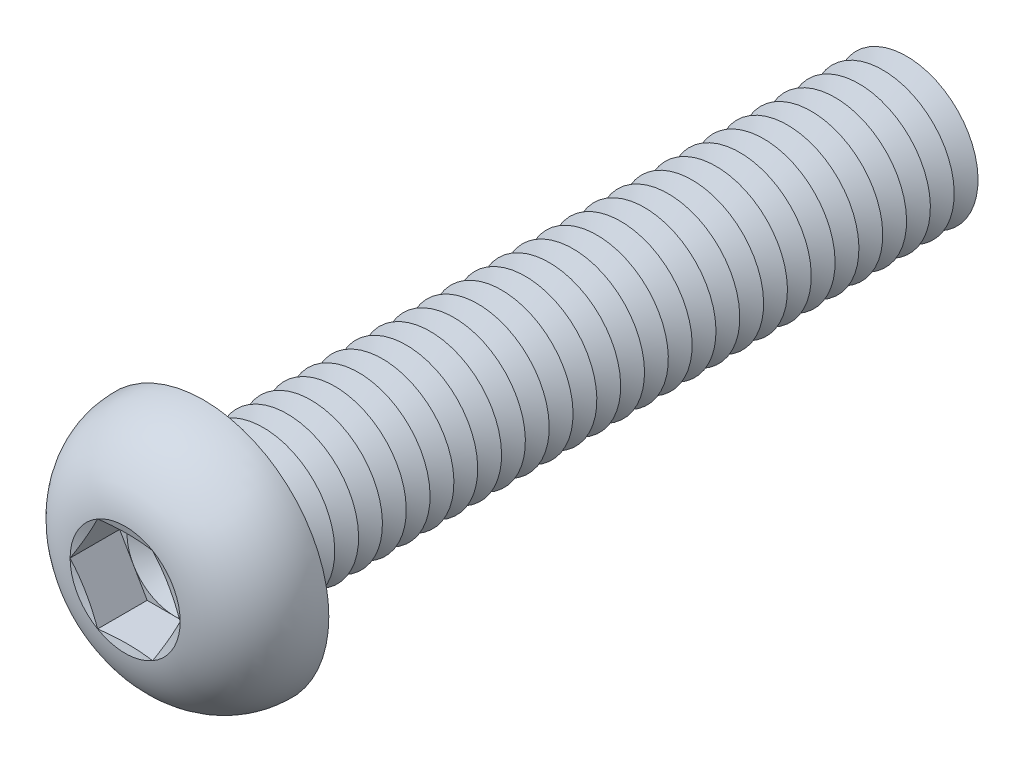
ISO-10303-21;
HEADER;
FILE_DESCRIPTION(('STEP AP214'),'2;1');
FILE_NAME('part.step','',(''),(''),'','','');
FILE_SCHEMA(('AUTOMOTIVE_DESIGN { 1 0 10303 214 1 1 1 1 }'));
ENDSEC;
DATA;
#1=APPLICATION_CONTEXT('core data for automotive mechanical design processes');
#2=APPLICATION_PROTOCOL_DEFINITION('international standard','automotive_design',2000,#1);
#3=PRODUCT_CONTEXT('',#1,'mechanical');
#4=PRODUCT('Part','Part','',(#3));
#5=PRODUCT_RELATED_PRODUCT_CATEGORY('part','',(#4));
#6=PRODUCT_DEFINITION_FORMATION('','',#4);
#7=PRODUCT_DEFINITION_CONTEXT('part definition',#1,'design');
#8=PRODUCT_DEFINITION('design','',#6,#7);
#9=PRODUCT_DEFINITION_SHAPE('','',#8);
#10=(LENGTH_UNIT() NAMED_UNIT(*) SI_UNIT(.MILLI.,.METRE.));
#11=(NAMED_UNIT(*) PLANE_ANGLE_UNIT() SI_UNIT($,.RADIAN.));
#12=(NAMED_UNIT(*) SI_UNIT($,.STERADIAN.) SOLID_ANGLE_UNIT());
#13=UNCERTAINTY_MEASURE_WITH_UNIT(LENGTH_MEASURE(1.E-05),#10,'distance_accuracy_value','');
#14=(GEOMETRIC_REPRESENTATION_CONTEXT(3) GLOBAL_UNCERTAINTY_ASSIGNED_CONTEXT((#13)) GLOBAL_UNIT_ASSIGNED_CONTEXT((#10,
#11,#12)) REPRESENTATION_CONTEXT('',''));
#15=CARTESIAN_POINT('',(0.,0.,0.));
#16=DIRECTION('',(0.,0.,1.));
#17=DIRECTION('',(1.,0.,0.));
#18=AXIS2_PLACEMENT_3D('',#15,#16,#17);
#19=CARTESIAN_POINT('',(0.,0.,1.22));
#20=DIRECTION('',(0.,0.,1.));
#21=DIRECTION('',(1.,0.,0.));
#22=AXIS2_PLACEMENT_3D('',#19,#20,#21);
#23=PLANE('',#22);
#24=CARTESIAN_POINT('',(0.,0.,1.22));
#25=DIRECTION('',(0.,0.,1.));
#26=DIRECTION('',(1.,0.,0.));
#27=AXIS2_PLACEMENT_3D('',#24,#25,#26);
#28=CIRCLE('',#27,1.99999906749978);
#29=CARTESIAN_POINT('',(1.73205,0.999999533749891,1.22));
#30=VERTEX_POINT('',#29);
#31=CARTESIAN_POINT('',(0.,1.99999906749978,1.22));
#32=VERTEX_POINT('',#31);
#33=EDGE_CURVE('E118',#30,#32,#28,.T.);
#34=ORIENTED_EDGE('',*,*,#33,.F.);
#35=DIRECTION('',(-0.5,0.866025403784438,0.));
#36=VECTOR('',#35,1.);
#37=CARTESIAN_POINT('',(2.3094,0.,1.22));
#38=LINE('',#37,#36);
#39=CARTESIAN_POINT('',(1.1547,1.99999906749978,1.22));
#40=VERTEX_POINT('',#39);
#41=EDGE_CURVE('E125',#30,#40,#38,.T.);
#42=ORIENTED_EDGE('',*,*,#41,.T.);
#43=DIRECTION('',(-1.,0.,0.));
#44=VECTOR('',#43,1.);
#45=CARTESIAN_POINT('',(1.1547,1.99999906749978,1.22));
#46=LINE('',#45,#44);
#47=EDGE_CURVE('E136',#40,#32,#46,.T.);
#48=ORIENTED_EDGE('',*,*,#47,.T.);
#49=EDGE_LOOP('',(#34,#42,#48));
#50=FACE_BOUND('',#49,.T.);
#51=ADVANCED_FACE('F39',(#50),#23,.T.);
#52=CARTESIAN_POINT('',(0.,0.,1.22));
#53=DIRECTION('',(0.,0.,1.));
#54=DIRECTION('',(1.,0.,0.));
#55=AXIS2_PLACEMENT_3D('',#52,#53,#54);
#56=CIRCLE('',#55,1.99999906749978);
#57=CARTESIAN_POINT('',(-1.73205,0.999999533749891,1.22));
#58=VERTEX_POINT('',#57);
#59=EDGE_CURVE('E11',#32,#58,#56,.T.);
#60=ORIENTED_EDGE('',*,*,#59,.F.);
#61=CARTESIAN_POINT('',(-1.1547,1.99999906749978,1.22));
#62=VERTEX_POINT('',#61);
#63=EDGE_CURVE('E131',#32,#62,#46,.T.);
#64=ORIENTED_EDGE('',*,*,#63,.T.);
#65=DIRECTION('',(-0.5,-0.866025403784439,0.));
#66=VECTOR('',#65,1.);
#67=CARTESIAN_POINT('',(-1.1547,1.99999906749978,1.22));
#68=LINE('',#67,#66);
#69=EDGE_CURVE('E134',#62,#58,#68,.T.);
#70=ORIENTED_EDGE('',*,*,#69,.T.);
#71=EDGE_LOOP('',(#60,#64,#70));
#72=FACE_BOUND('',#71,.T.);
#73=ADVANCED_FACE('F130',(#72),#23,.T.);
#74=CARTESIAN_POINT('',(-1.73205,-0.999999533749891,1.22));
#75=VERTEX_POINT('',#74);
#76=EDGE_CURVE('E49',#58,#75,#56,.T.);
#77=ORIENTED_EDGE('',*,*,#76,.F.);
#78=CARTESIAN_POINT('',(-2.3094,0.,1.22));
#79=VERTEX_POINT('',#78);
#80=EDGE_CURVE('E143',#58,#79,#68,.T.);
#81=ORIENTED_EDGE('',*,*,#80,.T.);
#82=DIRECTION('',(0.5,-0.866025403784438,0.));
#83=VECTOR('',#82,1.);
#84=CARTESIAN_POINT('',(-2.3094,0.,1.22));
#85=LINE('',#84,#83);
#86=EDGE_CURVE('E152',#79,#75,#85,.T.);
#87=ORIENTED_EDGE('',*,*,#86,.T.);
#88=EDGE_LOOP('',(#77,#81,#87));
#89=FACE_BOUND('',#88,.T.);
#90=ADVANCED_FACE('F507',(#89),#23,.T.);
#91=CARTESIAN_POINT('',(0.,-1.99999906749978,1.22));
#92=VERTEX_POINT('',#91);
#93=EDGE_CURVE('E491',#75,#92,#56,.T.);
#94=ORIENTED_EDGE('',*,*,#93,.F.);
#95=CARTESIAN_POINT('',(-1.1547,-1.99999906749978,1.22));
#96=VERTEX_POINT('',#95);
#97=EDGE_CURVE('E151',#75,#96,#85,.T.);
#98=ORIENTED_EDGE('',*,*,#97,.T.);
#99=DIRECTION('',(1.,0.,0.));
#100=VECTOR('',#99,1.);
#101=CARTESIAN_POINT('',(-1.1547,-1.99999906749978,1.22));
#102=LINE('',#101,#100);
#103=EDGE_CURVE('E157',#96,#92,#102,.T.);
#104=ORIENTED_EDGE('',*,*,#103,.T.);
#105=EDGE_LOOP('',(#94,#98,#104));
#106=FACE_BOUND('',#105,.T.);
#107=ADVANCED_FACE('F501',(#106),#23,.T.);
#108=CARTESIAN_POINT('',(1.73205,-0.999999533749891,1.22));
#109=VERTEX_POINT('',#108);
#110=EDGE_CURVE('E56',#92,#109,#56,.T.);
#111=ORIENTED_EDGE('',*,*,#110,.F.);
#112=CARTESIAN_POINT('',(1.1547,-1.99999906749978,1.22));
#113=VERTEX_POINT('',#112);
#114=EDGE_CURVE('E156',#92,#113,#102,.T.);
#115=ORIENTED_EDGE('',*,*,#114,.T.);
#116=DIRECTION('',(0.5,0.866025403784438,0.));
#117=VECTOR('',#116,1.);
#118=CARTESIAN_POINT('',(1.1547,-1.99999906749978,1.22));
#119=LINE('',#118,#117);
#120=EDGE_CURVE('E162',#113,#109,#119,.T.);
#121=ORIENTED_EDGE('',*,*,#120,.T.);
#122=EDGE_LOOP('',(#111,#115,#121));
#123=FACE_BOUND('',#122,.T.);
#124=ADVANCED_FACE('F578',(#123),#23,.T.);
#125=CARTESIAN_POINT('',(0.,0.,3.3));
#126=DIRECTION('',(0.,0.,1.));
#127=DIRECTION('',(0.,-1.,0.));
#128=AXIS2_PLACEMENT_3D('',#125,#126,#127);
#129=CONICAL_SURFACE('',#128,2.3094,1.30899693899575);
#130=CARTESIAN_POINT('',(2.30951547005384,-0.000200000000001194,3.30003094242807));
#131=CARTESIAN_POINT('',(2.26155412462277,0.0828714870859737,3.2871729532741));
#132=CARTESIAN_POINT('',(2.21350580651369,0.166093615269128,3.27549992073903));
#133=CARTESIAN_POINT('',(2.11723944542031,0.332831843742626,3.2549913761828));
#134=CARTESIAN_POINT('',(2.06902134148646,0.416348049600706,3.24615701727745));
#135=CARTESIAN_POINT('',(1.97270782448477,0.583167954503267,3.23184167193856));
#136=CARTESIAN_POINT('',(1.92461306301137,0.666470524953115,3.22634360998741));
#137=CARTESIAN_POINT('',(1.82836219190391,0.833181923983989,3.21897125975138));
#138=CARTESIAN_POINT('',(1.78020609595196,0.916590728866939,3.21709626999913));
#139=CARTESIAN_POINT('',(1.68389390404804,1.08340833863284,3.21709626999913));
#140=CARTESIAN_POINT('',(1.63573780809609,1.16681714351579,3.21897125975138));
#141=CARTESIAN_POINT('',(1.53948693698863,1.33352854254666,3.22634360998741));
#142=CARTESIAN_POINT('',(1.49139217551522,1.41683111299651,3.23184167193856));
#143=CARTESIAN_POINT('',(1.39507865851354,1.58365101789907,3.24615701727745));
#144=CARTESIAN_POINT('',(1.34686055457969,1.66716722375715,3.2549913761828));
#145=CARTESIAN_POINT('',(1.25059419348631,1.83390545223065,3.27549992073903));
#146=CARTESIAN_POINT('',(1.20254587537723,1.9171275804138,3.2871729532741));
#147=CARTESIAN_POINT('',(1.15458452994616,2.00019906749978,3.30003094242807));
#148=B_SPLINE_CURVE_WITH_KNOTS('',3,(#130,#131,#132,#133,#134,#135,#136,#137,#138,#139,#140,
#141,#142,#143,#144,#145,#146,#147),.UNSPECIFIED.,.F.,.F.,(4,2,2,2,2,2,2,2,4),(0.,
0.290357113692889,0.580832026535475,0.869807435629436,1.15872689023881,1.44764634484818,
1.73662175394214,2.02709666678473,2.31745378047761),.UNSPECIFIED.);
#149=CARTESIAN_POINT('',(2.3094,0.,3.3));
#150=VERTEX_POINT('',#149);
#151=CARTESIAN_POINT('',(1.15469999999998,1.99999906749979,3.3));
#152=VERTEX_POINT('',#151);
#153=EDGE_CURVE('E221',#150,#152,#148,.T.);
#154=ORIENTED_EDGE('',*,*,#153,.F.);
#155=CARTESIAN_POINT('',(0.,0.,3.3));
#156=DIRECTION('',(0.,0.,-1.));
#157=DIRECTION('',(0.,1.,0.));
#158=AXIS2_PLACEMENT_3D('',#155,#156,#157);
#159=CIRCLE('',#158,2.3094);
#160=EDGE_CURVE('E477',#152,#150,#159,.T.);
#161=ORIENTED_EDGE('',*,*,#160,.F.);
#162=EDGE_LOOP('',(#154,#161));
#163=FACE_BOUND('',#162,.T.);
#164=ADVANCED_FACE('F582',(#163),#129,.F.);
#165=CARTESIAN_POINT('',(1.15458452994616,-2.00019906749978,3.30003094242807));
#166=CARTESIAN_POINT('',(1.20254587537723,-1.91712758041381,3.2871729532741));
#167=CARTESIAN_POINT('',(1.25059419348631,-1.83390545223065,3.27549992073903));
#168=CARTESIAN_POINT('',(1.34686055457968,-1.66716722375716,3.2549913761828));
#169=CARTESIAN_POINT('',(1.39507865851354,-1.58365101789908,3.24615701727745));
#170=CARTESIAN_POINT('',(1.49139217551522,-1.41683111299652,3.23184167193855));
#171=CARTESIAN_POINT('',(1.53948693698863,-1.33352854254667,3.22634360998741));
#172=CARTESIAN_POINT('',(1.63573780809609,-1.16681714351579,3.21897125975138));
#173=CARTESIAN_POINT('',(1.68389390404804,-1.08340833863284,3.21709626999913));
#174=CARTESIAN_POINT('',(1.78020609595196,-0.916590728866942,3.21709626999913));
#175=CARTESIAN_POINT('',(1.82836219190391,-0.833181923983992,3.21897125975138));
#176=CARTESIAN_POINT('',(1.92461306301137,-0.666470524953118,3.22634360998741));
#177=CARTESIAN_POINT('',(1.97270782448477,-0.58316795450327,3.23184167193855));
#178=CARTESIAN_POINT('',(2.06902134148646,-0.416348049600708,3.24615701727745));
#179=CARTESIAN_POINT('',(2.11723944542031,-0.332831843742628,3.2549913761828));
#180=CARTESIAN_POINT('',(2.21350580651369,-0.16609361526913,3.27549992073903));
#181=CARTESIAN_POINT('',(2.26155412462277,-0.0828714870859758,3.2871729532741));
#182=CARTESIAN_POINT('',(2.30951547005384,0.000199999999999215,3.30003094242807));
#183=B_SPLINE_CURVE_WITH_KNOTS('',3,(#165,#166,#167,#168,#169,#170,#171,#172,#173,#174,#175,
#176,#177,#178,#179,#180,#181,#182),.UNSPECIFIED.,.F.,.F.,(4,2,2,2,2,2,2,2,4),(0.,
0.290357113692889,0.580832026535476,0.869807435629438,1.15872689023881,1.44764634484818,
1.73662175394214,2.02709666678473,2.31745378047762),.UNSPECIFIED.);
#184=CARTESIAN_POINT('',(1.1547,-1.99999906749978,3.3));
#185=VERTEX_POINT('',#184);
#186=EDGE_CURVE('E230',#185,#150,#183,.T.);
#187=ORIENTED_EDGE('',*,*,#186,.F.);
#188=EDGE_CURVE('E482',#150,#185,#159,.T.);
#189=ORIENTED_EDGE('',*,*,#188,.F.);
#190=EDGE_LOOP('',(#187,#189));
#191=FACE_BOUND('',#190,.T.);
#192=ADVANCED_FACE('F542',(#191),#129,.F.);
#193=CARTESIAN_POINT('',(-3.4849337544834,-1.99999906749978,3.75783251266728));
#194=CARTESIAN_POINT('',(-3.40057136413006,-1.99999906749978,3.7382285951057));
#195=CARTESIAN_POINT('',(-3.31617090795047,-1.99999906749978,3.71878852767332));
#196=CARTESIAN_POINT('',(-3.14727791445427,-1.99999906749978,3.68030638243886));
#197=CARTESIAN_POINT('',(-3.06278537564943,-1.99999906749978,3.66126431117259));
#198=CARTESIAN_POINT('',(-2.80911712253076,-1.99999906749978,3.60483420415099));
#199=CARTESIAN_POINT('',(-2.63978343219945,-1.99999906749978,3.5681499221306));
#200=CARTESIAN_POINT('',(-2.29895421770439,-1.99999906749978,3.49717072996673));
#201=CARTESIAN_POINT('',(-2.12745330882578,-1.99999906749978,3.4629014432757));
#202=CARTESIAN_POINT('',(-1.78364663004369,-1.99999906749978,3.39849485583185));
#203=CARTESIAN_POINT('',(-1.61134079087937,-1.99999906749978,3.36835791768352));
#204=CARTESIAN_POINT('',(-1.27040784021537,-1.99999906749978,3.31501553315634));
#205=CARTESIAN_POINT('',(-1.10180724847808,-1.99999906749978,3.29164468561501));
#206=CARTESIAN_POINT('',(-0.763641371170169,-1.99999906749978,3.2533727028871));
#207=CARTESIAN_POINT('',(-0.594076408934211,-1.99999906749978,3.23846888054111));
#208=CARTESIAN_POINT('',(-0.339649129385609,-1.99999906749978,3.22431372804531));
#209=CARTESIAN_POINT('',(-0.255009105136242,-1.99999906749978,3.22096057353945));
#210=CARTESIAN_POINT('',(-0.0856618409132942,-1.99999906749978,3.21711210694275));
#211=CARTESIAN_POINT('',(-0.000954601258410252,-1.99999906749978,3.21661678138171));
#212=CARTESIAN_POINT('',(0.16843098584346,-1.99999906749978,3.21851478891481));
#213=CARTESIAN_POINT('',(0.253109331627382,-1.99999906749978,3.22090826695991));
#214=CARTESIAN_POINT('',(0.422344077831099,-1.99999906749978,3.22845792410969));
#215=CARTESIAN_POINT('',(0.506900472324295,-1.99999906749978,3.23361423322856));
#216=CARTESIAN_POINT('',(0.712240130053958,-1.99999906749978,3.24921577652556));
#217=CARTESIAN_POINT('',(0.832922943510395,-1.99999906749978,3.26098285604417));
#218=CARTESIAN_POINT('',(1.07378161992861,-1.99999906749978,3.28874908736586));
#219=CARTESIAN_POINT('',(1.1939575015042,-1.99999906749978,3.30474808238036));
#220=CARTESIAN_POINT('',(1.43419655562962,-1.99999906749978,3.34009172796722));
#221=CARTESIAN_POINT('',(1.55425817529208,-1.99999906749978,3.35944677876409));
#222=CARTESIAN_POINT('',(1.79394991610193,-1.99999906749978,3.40067076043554));
#223=CARTESIAN_POINT('',(1.91358001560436,-1.99999906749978,3.42253981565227));
#224=CARTESIAN_POINT('',(2.15493405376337,-1.99999906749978,3.46864194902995));
#225=CARTESIAN_POINT('',(2.27665041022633,-1.99999906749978,3.49291441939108));
#226=CARTESIAN_POINT('',(2.51977680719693,-1.99999906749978,3.54294628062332));
#227=CARTESIAN_POINT('',(2.64118684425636,-1.99999906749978,3.56870568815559));
#228=CARTESIAN_POINT('',(2.88310060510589,-1.99999906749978,3.6212089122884));
#229=CARTESIAN_POINT('',(3.00360566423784,-1.99999906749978,3.6479466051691));
#230=CARTESIAN_POINT('',(3.24441021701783,-1.99999906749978,3.70229477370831));
#231=CARTESIAN_POINT('',(3.36470972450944,-1.99999906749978,3.72990518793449));
#232=CARTESIAN_POINT('',(3.4849337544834,-1.99999906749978,3.75783251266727));
#233=B_SPLINE_CURVE_WITH_KNOTS('',3,(#193,#194,#195,#196,#197,#198,#199,#200,#201,#202,#203,
#204,#205,#206,#207,#208,#209,#210,#211,#212,#213,#214,#215,#216,#217,#218,#219,#220,#221,#222,
#223,#224,#225,#226,#227,#228,#229,#230,#231,#232),.UNSPECIFIED.,.F.,.F.,(4,2,2,2,2,2,2,2,2,2,2,
2,2,2,2,2,2,2,2,4),(0.,0.259830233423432,0.519664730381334,1.03943435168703,1.56407662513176,
2.08876490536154,2.59926476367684,3.10960251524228,3.36367930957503,3.61775490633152,
3.87184325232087,4.1259435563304,4.48960924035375,4.85326145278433,5.21806142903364,
5.58287945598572,5.95520617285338,6.32753706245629,6.69784064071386,7.06811821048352),.UNSPECIFIED.);
#234=CARTESIAN_POINT('',(-1.1547,-1.99999906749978,3.3));
#235=VERTEX_POINT('',#234);
#236=EDGE_CURVE('E521',#235,#185,#233,.T.);
#237=ORIENTED_EDGE('',*,*,#236,.F.);
#238=EDGE_CURVE('E534',#185,#235,#159,.T.);
#239=ORIENTED_EDGE('',*,*,#238,.F.);
#240=EDGE_LOOP('',(#237,#239));
#241=FACE_BOUND('',#240,.T.);
#242=ADVANCED_FACE('F548',(#241),#129,.F.);
#243=CARTESIAN_POINT('',(-2.30951547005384,0.000199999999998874,3.30003094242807));
#244=CARTESIAN_POINT('',(-2.26155412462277,-0.0828714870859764,3.2871729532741));
#245=CARTESIAN_POINT('',(-2.21350580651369,-0.166093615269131,3.27549992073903));
#246=CARTESIAN_POINT('',(-2.11723944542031,-0.332831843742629,3.2549913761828));
#247=CARTESIAN_POINT('',(-2.06902134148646,-0.416348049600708,3.24615701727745));
#248=CARTESIAN_POINT('',(-1.97270782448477,-0.58316795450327,3.23184167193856));
#249=CARTESIAN_POINT('',(-1.92461306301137,-0.666470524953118,3.22634360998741));
#250=CARTESIAN_POINT('',(-1.82836219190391,-0.833181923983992,3.21897125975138));
#251=CARTESIAN_POINT('',(-1.78020609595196,-0.916590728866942,3.21709626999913));
#252=CARTESIAN_POINT('',(-1.68389390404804,-1.08340833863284,3.21709626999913));
#253=CARTESIAN_POINT('',(-1.63573780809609,-1.16681714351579,3.21897125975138));
#254=CARTESIAN_POINT('',(-1.53948693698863,-1.33352854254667,3.22634360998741));
#255=CARTESIAN_POINT('',(-1.49139217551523,-1.41683111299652,3.23184167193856));
#256=CARTESIAN_POINT('',(-1.39507865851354,-1.58365101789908,3.24615701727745));
#257=CARTESIAN_POINT('',(-1.34686055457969,-1.66716722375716,3.2549913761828));
#258=CARTESIAN_POINT('',(-1.25059419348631,-1.83390545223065,3.27549992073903));
#259=CARTESIAN_POINT('',(-1.20254587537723,-1.91712758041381,3.2871729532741));
#260=CARTESIAN_POINT('',(-1.15458452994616,-2.00019906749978,3.30003094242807));
#261=B_SPLINE_CURVE_WITH_KNOTS('',3,(#243,#244,#245,#246,#247,#248,#249,#250,#251,#252,#253,
#254,#255,#256,#257,#258,#259,#260),.UNSPECIFIED.,.F.,.F.,(4,2,2,2,2,2,2,2,4),(0.,
0.290357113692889,0.580832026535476,0.869807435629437,1.15872689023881,1.44764634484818,
1.73662175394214,2.02709666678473,2.31745378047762),.UNSPECIFIED.);
#262=CARTESIAN_POINT('',(-2.3094,0.,3.3));
#263=VERTEX_POINT('',#262);
#264=EDGE_CURVE('E512',#263,#235,#261,.T.);
#265=ORIENTED_EDGE('',*,*,#264,.F.);
#266=EDGE_CURVE('E518',#235,#263,#159,.T.);
#267=ORIENTED_EDGE('',*,*,#266,.F.);
#268=EDGE_LOOP('',(#265,#267));
#269=FACE_BOUND('',#268,.T.);
#270=ADVANCED_FACE('F516',(#269),#129,.F.);
#271=CARTESIAN_POINT('',(-1.15458452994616,2.00019906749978,3.30003094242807));
#272=CARTESIAN_POINT('',(-1.20254587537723,1.9171275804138,3.2871729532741));
#273=CARTESIAN_POINT('',(-1.25059419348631,1.83390545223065,3.27549992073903));
#274=CARTESIAN_POINT('',(-1.34686055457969,1.66716722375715,3.2549913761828));
#275=CARTESIAN_POINT('',(-1.39507865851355,1.58365101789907,3.24615701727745));
#276=CARTESIAN_POINT('',(-1.49139217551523,1.41683111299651,3.23184167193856));
#277=CARTESIAN_POINT('',(-1.53948693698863,1.33352854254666,3.22634360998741));
#278=CARTESIAN_POINT('',(-1.63573780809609,1.16681714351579,3.21897125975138));
#279=CARTESIAN_POINT('',(-1.68389390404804,1.08340833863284,3.21709626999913));
#280=CARTESIAN_POINT('',(-1.78020609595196,0.916590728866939,3.21709626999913));
#281=CARTESIAN_POINT('',(-1.82836219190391,0.833181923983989,3.21897125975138));
#282=CARTESIAN_POINT('',(-1.92461306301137,0.666470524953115,3.22634360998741));
#283=CARTESIAN_POINT('',(-1.97270782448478,0.583167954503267,3.23184167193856));
#284=CARTESIAN_POINT('',(-2.06902134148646,0.416348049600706,3.24615701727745));
#285=CARTESIAN_POINT('',(-2.11723944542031,0.332831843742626,3.2549913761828));
#286=CARTESIAN_POINT('',(-2.21350580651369,0.166093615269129,3.27549992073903));
#287=CARTESIAN_POINT('',(-2.26155412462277,0.0828714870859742,3.2871729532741));
#288=CARTESIAN_POINT('',(-2.30951547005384,-0.000200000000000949,3.30003094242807));
#289=B_SPLINE_CURVE_WITH_KNOTS('',3,(#271,#272,#273,#274,#275,#276,#277,#278,#279,#280,#281,
#282,#283,#284,#285,#286,#287,#288),.UNSPECIFIED.,.F.,.F.,(4,2,2,2,2,2,2,2,4),(0.,
0.290357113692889,0.580832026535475,0.869807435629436,1.15872689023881,1.44764634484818,
1.73662175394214,2.02709666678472,2.31745378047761),.UNSPECIFIED.);
#290=CARTESIAN_POINT('',(-1.1547,1.99999906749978,3.3));
#291=VERTEX_POINT('',#290);
#292=EDGE_CURVE('E195',#291,#263,#289,.T.);
#293=ORIENTED_EDGE('',*,*,#292,.F.);
#294=EDGE_CURVE('E524',#263,#291,#159,.T.);
#295=ORIENTED_EDGE('',*,*,#294,.F.);
#296=EDGE_LOOP('',(#293,#295));
#297=FACE_BOUND('',#296,.T.);
#298=ADVANCED_FACE('F525',(#297),#129,.F.);
#299=CARTESIAN_POINT('',(0.,0.,-26.5));
#300=DIRECTION('',(0.,0.,1.));
#301=DIRECTION('',(0.,-1.,0.));
#302=AXIS2_PLACEMENT_3D('',#299,#300,#301);
#303=CONICAL_SURFACE('',#302,2.99999999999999,1.0471975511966);
#304=CARTESIAN_POINT('',(0.,0.,-27.));
#305=DIRECTION('',(0.,0.,1.));
#306=DIRECTION('',(0.,-1.,0.));
#307=AXIS2_PLACEMENT_3D('',#304,#305,#306);
#308=CIRCLE('',#307,2.13397459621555);
#309=CARTESIAN_POINT('',(0.,-2.13397459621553,-27.));
#310=VERTEX_POINT('',#309);
#311=EDGE_CURVE('E448',#310,#310,#308,.T.);
#312=ORIENTED_EDGE('',*,*,#311,.T.);
#313=EDGE_LOOP('',(#312));
#314=FACE_BOUND('',#313,.T.);
#315=CARTESIAN_POINT('',(0.,0.,-26.5));
#316=DIRECTION('',(0.,0.,1.));
#317=DIRECTION('',(0.,-1.,0.));
#318=AXIS2_PLACEMENT_3D('',#315,#316,#317);
#319=CIRCLE('',#318,2.99999999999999);
#320=CARTESIAN_POINT('',(0.,-2.99999999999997,-26.5));
#321=VERTEX_POINT('',#320);
#322=EDGE_CURVE('E444',#321,#321,#319,.T.);
#323=ORIENTED_EDGE('',*,*,#322,.F.);
#324=EDGE_LOOP('',(#323));
#325=FACE_BOUND('',#324,.T.);
#326=ADVANCED_FACE('F609',(#314,#325),#303,.T.);
#327=CARTESIAN_POINT('',(0.,0.,-27.));
#328=DIRECTION('',(0.,0.,-1.));
#329=DIRECTION('',(0.,1.,0.));
#330=AXIS2_PLACEMENT_3D('',#327,#328,#329);
#331=CONICAL_SURFACE('',#330,2.13397459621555,1.0471975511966);
#332=CARTESIAN_POINT('',(0.,0.,-27.5));
#333=DIRECTION('',(0.,0.,1.));
#334=DIRECTION('',(0.,-1.,0.));
#335=AXIS2_PLACEMENT_3D('',#332,#333,#334);
#336=CIRCLE('',#335,2.99999999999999);
#337=CARTESIAN_POINT('',(0.,-2.99999999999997,-27.5));
#338=VERTEX_POINT('',#337);
#339=EDGE_CURVE('E452',#338,#338,#336,.T.);
#340=ORIENTED_EDGE('',*,*,#339,.T.);
#341=EDGE_LOOP('',(#340));
#342=FACE_BOUND('',#341,.T.);
#343=ORIENTED_EDGE('',*,*,#311,.F.);
#344=EDGE_LOOP('',(#343));
#345=FACE_BOUND('',#344,.T.);
#346=ADVANCED_FACE('F614',(#342,#345),#331,.T.);
#347=CARTESIAN_POINT('',(0.,3.,-30.));
#348=DIRECTION('',(0.,0.,-1.));
#349=DIRECTION('',(0.,1.,0.));
#350=AXIS2_PLACEMENT_3D('',#347,#348,#349);
#351=PLANE('',#350);
#352=CARTESIAN_POINT('',(0.,0.,-30.));
#353=DIRECTION('',(0.,0.,1.));
#354=DIRECTION('',(0.,-1.,0.));
#355=AXIS2_PLACEMENT_3D('',#352,#353,#354);
#356=CIRCLE('',#355,2.13397459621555);
#357=CARTESIAN_POINT('',(0.,-2.13397459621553,-30.));
#358=VERTEX_POINT('',#357);
#359=EDGE_CURVE('E472',#358,#358,#356,.T.);
#360=ORIENTED_EDGE('',*,*,#359,.F.);
#361=EDGE_LOOP('',(#360));
#362=FACE_BOUND('',#361,.T.);
#363=ADVANCED_FACE('F781',(#362),#351,.T.);
#364=CARTESIAN_POINT('',(0.,0.,-29.5));
#365=DIRECTION('',(0.,0.,1.));
#366=DIRECTION('',(0.,-1.,0.));
#367=AXIS2_PLACEMENT_3D('',#364,#365,#366);
#368=CONICAL_SURFACE('',#367,2.99999999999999,1.0471975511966);
#369=ORIENTED_EDGE('',*,*,#359,.T.);
#370=EDGE_LOOP('',(#369));
#371=FACE_BOUND('',#370,.T.);
#372=CARTESIAN_POINT('',(0.,0.,-29.5));
#373=DIRECTION('',(0.,0.,1.));
#374=DIRECTION('',(0.,-1.,0.));
#375=AXIS2_PLACEMENT_3D('',#372,#373,#374);
#376=CIRCLE('',#375,2.99999999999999);
#377=CARTESIAN_POINT('',(0.,-2.99999999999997,-29.5));
#378=VERTEX_POINT('',#377);
#379=EDGE_CURVE('E468',#378,#378,#376,.T.);
#380=ORIENTED_EDGE('',*,*,#379,.F.);
#381=EDGE_LOOP('',(#380));
#382=FACE_BOUND('',#381,.T.);
#383=ADVANCED_FACE('F774',(#371,#382),#368,.T.);
#384=CARTESIAN_POINT('',(0.,0.,-29.));
#385=DIRECTION('',(0.,0.,-1.));
#386=DIRECTION('',(0.,1.,0.));
#387=AXIS2_PLACEMENT_3D('',#384,#385,#386);
#388=CONICAL_SURFACE('',#387,2.13397459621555,1.0471975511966);
#389=ORIENTED_EDGE('',*,*,#379,.T.);
#390=EDGE_LOOP('',(#389));
#391=FACE_BOUND('',#390,.T.);
#392=CARTESIAN_POINT('',(0.,0.,-29.));
#393=DIRECTION('',(0.,0.,1.));
#394=DIRECTION('',(0.,-1.,0.));
#395=AXIS2_PLACEMENT_3D('',#392,#393,#394);
#396=CIRCLE('',#395,2.13397459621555);
#397=CARTESIAN_POINT('',(0.,-2.13397459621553,-29.));
#398=VERTEX_POINT('',#397);
#399=EDGE_CURVE('E464',#398,#398,#396,.T.);
#400=ORIENTED_EDGE('',*,*,#399,.F.);
#401=EDGE_LOOP('',(#400));
#402=FACE_BOUND('',#401,.T.);
#403=ADVANCED_FACE('F780',(#391,#402),#388,.T.);
#404=CARTESIAN_POINT('',(0.,0.,-28.5));
#405=DIRECTION('',(0.,0.,1.));
#406=DIRECTION('',(0.,-1.,0.));
#407=AXIS2_PLACEMENT_3D('',#404,#405,#406);
#408=CONICAL_SURFACE('',#407,2.99999999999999,1.0471975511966);
#409=ORIENTED_EDGE('',*,*,#399,.T.);
#410=EDGE_LOOP('',(#409));
#411=FACE_BOUND('',#410,.T.);
#412=CARTESIAN_POINT('',(0.,0.,-28.5));
#413=DIRECTION('',(0.,0.,1.));
#414=DIRECTION('',(0.,-1.,0.));
#415=AXIS2_PLACEMENT_3D('',#412,#413,#414);
#416=CIRCLE('',#415,2.99999999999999);
#417=CARTESIAN_POINT('',(0.,-2.99999999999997,-28.5));
#418=VERTEX_POINT('',#417);
#419=EDGE_CURVE('E460',#418,#418,#416,.T.);
#420=ORIENTED_EDGE('',*,*,#419,.F.);
#421=EDGE_LOOP('',(#420));
#422=FACE_BOUND('',#421,.T.);
#423=ADVANCED_FACE('F812',(#411,#422),#408,.T.);
#424=CARTESIAN_POINT('',(0.,0.,-28.));
#425=DIRECTION('',(0.,0.,-1.));
#426=DIRECTION('',(0.,1.,0.));
#427=AXIS2_PLACEMENT_3D('',#424,#425,#426);
#428=CONICAL_SURFACE('',#427,2.13397459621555,1.0471975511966);
#429=ORIENTED_EDGE('',*,*,#419,.T.);
#430=EDGE_LOOP('',(#429));
#431=FACE_BOUND('',#430,.T.);
#432=CARTESIAN_POINT('',(0.,0.,-28.));
#433=DIRECTION('',(0.,0.,1.));
#434=DIRECTION('',(0.,-1.,0.));
#435=AXIS2_PLACEMENT_3D('',#432,#433,#434);
#436=CIRCLE('',#435,2.13397459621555);
#437=CARTESIAN_POINT('',(0.,-2.13397459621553,-28.));
#438=VERTEX_POINT('',#437);
#439=EDGE_CURVE('E456',#438,#438,#436,.T.);
#440=ORIENTED_EDGE('',*,*,#439,.F.);
#441=EDGE_LOOP('',(#440));
#442=FACE_BOUND('',#441,.T.);
#443=ADVANCED_FACE('F822',(#431,#442),#428,.T.);
#444=CARTESIAN_POINT('',(0.,0.,-27.5));
#445=DIRECTION('',(0.,0.,1.));
#446=DIRECTION('',(0.,-1.,0.));
#447=AXIS2_PLACEMENT_3D('',#444,#445,#446);
#448=CONICAL_SURFACE('',#447,2.99999999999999,1.0471975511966);
#449=ORIENTED_EDGE('',*,*,#439,.T.);
#450=EDGE_LOOP('',(#449));
#451=FACE_BOUND('',#450,.T.);
#452=ORIENTED_EDGE('',*,*,#339,.F.);
#453=EDGE_LOOP('',(#452));
#454=FACE_BOUND('',#453,.T.);
#455=ADVANCED_FACE('F832',(#451,#454),#448,.T.);
#456=CARTESIAN_POINT('',(0.,0.,-25.5));
#457=DIRECTION('',(0.,0.,1.));
#458=DIRECTION('',(0.,-1.,0.));
#459=AXIS2_PLACEMENT_3D('',#456,#457,#458);
#460=CONICAL_SURFACE('',#459,2.99999999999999,1.0471975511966);
#461=CARTESIAN_POINT('',(0.,0.,-26.));
#462=DIRECTION('',(0.,0.,1.));
#463=DIRECTION('',(0.,-1.,0.));
#464=AXIS2_PLACEMENT_3D('',#461,#462,#463);
#465=CIRCLE('',#464,2.13397459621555);
#466=CARTESIAN_POINT('',(0.,-2.13397459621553,-26.));
#467=VERTEX_POINT('',#466);
#468=EDGE_CURVE('E440',#467,#467,#465,.T.);
#469=ORIENTED_EDGE('',*,*,#468,.T.);
#470=EDGE_LOOP('',(#469));
#471=FACE_BOUND('',#470,.T.);
#472=CARTESIAN_POINT('',(0.,0.,-25.5));
#473=DIRECTION('',(0.,0.,1.));
#474=DIRECTION('',(0.,-1.,0.));
#475=AXIS2_PLACEMENT_3D('',#472,#473,#474);
#476=CIRCLE('',#475,2.99999999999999);
#477=CARTESIAN_POINT('',(0.,-2.99999999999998,-25.5));
#478=VERTEX_POINT('',#477);
#479=EDGE_CURVE('E436',#478,#478,#476,.T.);
#480=ORIENTED_EDGE('',*,*,#479,.F.);
#481=EDGE_LOOP('',(#480));
#482=FACE_BOUND('',#481,.T.);
#483=ADVANCED_FACE('F842',(#471,#482),#460,.T.);
#484=CARTESIAN_POINT('',(0.,0.,-26.));
#485=DIRECTION('',(0.,0.,-1.));
#486=DIRECTION('',(0.,1.,0.));
#487=AXIS2_PLACEMENT_3D('',#484,#485,#486);
#488=CONICAL_SURFACE('',#487,2.13397459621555,1.0471975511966);
#489=ORIENTED_EDGE('',*,*,#322,.T.);
#490=EDGE_LOOP('',(#489));
#491=FACE_BOUND('',#490,.T.);
#492=ORIENTED_EDGE('',*,*,#468,.F.);
#493=EDGE_LOOP('',(#492));
#494=FACE_BOUND('',#493,.T.);
#495=ADVANCED_FACE('F852',(#491,#494),#488,.T.);
#496=CARTESIAN_POINT('',(0.,0.,-24.5));
#497=DIRECTION('',(0.,0.,1.));
#498=DIRECTION('',(0.,-1.,0.));
#499=AXIS2_PLACEMENT_3D('',#496,#497,#498);
#500=CONICAL_SURFACE('',#499,2.99999999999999,1.0471975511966);
#501=CARTESIAN_POINT('',(0.,0.,-25.));
#502=DIRECTION('',(0.,0.,1.));
#503=DIRECTION('',(0.,-1.,0.));
#504=AXIS2_PLACEMENT_3D('',#501,#502,#503);
#505=CIRCLE('',#504,2.13397459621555);
#506=CARTESIAN_POINT('',(0.,-2.13397459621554,-25.));
#507=VERTEX_POINT('',#506);
#508=EDGE_CURVE('E432',#507,#507,#505,.T.);
#509=ORIENTED_EDGE('',*,*,#508,.T.);
#510=EDGE_LOOP('',(#509));
#511=FACE_BOUND('',#510,.T.);
#512=CARTESIAN_POINT('',(0.,0.,-24.5));
#513=DIRECTION('',(0.,0.,1.));
#514=DIRECTION('',(0.,-1.,0.));
#515=AXIS2_PLACEMENT_3D('',#512,#513,#514);
#516=CIRCLE('',#515,2.99999999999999);
#517=CARTESIAN_POINT('',(0.,-2.99999999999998,-24.5));
#518=VERTEX_POINT('',#517);
#519=EDGE_CURVE('E428',#518,#518,#516,.T.);
#520=ORIENTED_EDGE('',*,*,#519,.F.);
#521=EDGE_LOOP('',(#520));
#522=FACE_BOUND('',#521,.T.);
#523=ADVANCED_FACE('F862',(#511,#522),#500,.T.);
#524=CARTESIAN_POINT('',(0.,0.,-25.));
#525=DIRECTION('',(0.,0.,-1.));
#526=DIRECTION('',(0.,1.,0.));
#527=AXIS2_PLACEMENT_3D('',#524,#525,#526);
#528=CONICAL_SURFACE('',#527,2.13397459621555,1.0471975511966);
#529=ORIENTED_EDGE('',*,*,#479,.T.);
#530=EDGE_LOOP('',(#529));
#531=FACE_BOUND('',#530,.T.);
#532=ORIENTED_EDGE('',*,*,#508,.F.);
#533=EDGE_LOOP('',(#532));
#534=FACE_BOUND('',#533,.T.);
#535=ADVANCED_FACE('F872',(#531,#534),#528,.T.);
#536=CARTESIAN_POINT('',(0.,0.,-23.5));
#537=DIRECTION('',(0.,0.,1.));
#538=DIRECTION('',(0.,-1.,0.));
#539=AXIS2_PLACEMENT_3D('',#536,#537,#538);
#540=CONICAL_SURFACE('',#539,2.99999999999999,1.0471975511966);
#541=CARTESIAN_POINT('',(0.,0.,-24.));
#542=DIRECTION('',(0.,0.,1.));
#543=DIRECTION('',(0.,-1.,0.));
#544=AXIS2_PLACEMENT_3D('',#541,#542,#543);
#545=CIRCLE('',#544,2.13397459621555);
#546=CARTESIAN_POINT('',(0.,-2.13397459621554,-24.));
#547=VERTEX_POINT('',#546);
#548=EDGE_CURVE('E424',#547,#547,#545,.T.);
#549=ORIENTED_EDGE('',*,*,#548,.T.);
#550=EDGE_LOOP('',(#549));
#551=FACE_BOUND('',#550,.T.);
#552=CARTESIAN_POINT('',(0.,0.,-23.5));
#553=DIRECTION('',(0.,0.,1.));
#554=DIRECTION('',(0.,-1.,0.));
#555=AXIS2_PLACEMENT_3D('',#552,#553,#554);
#556=CIRCLE('',#555,2.99999999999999);
#557=CARTESIAN_POINT('',(0.,-2.99999999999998,-23.5));
#558=VERTEX_POINT('',#557);
#559=EDGE_CURVE('E420',#558,#558,#556,.T.);
#560=ORIENTED_EDGE('',*,*,#559,.F.);
#561=EDGE_LOOP('',(#560));
#562=FACE_BOUND('',#561,.T.);
#563=ADVANCED_FACE('F882',(#551,#562),#540,.T.);
#564=CARTESIAN_POINT('',(0.,0.,-24.));
#565=DIRECTION('',(0.,0.,-1.));
#566=DIRECTION('',(0.,1.,0.));
#567=AXIS2_PLACEMENT_3D('',#564,#565,#566);
#568=CONICAL_SURFACE('',#567,2.13397459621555,1.0471975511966);
#569=ORIENTED_EDGE('',*,*,#519,.T.);
#570=EDGE_LOOP('',(#569));
#571=FACE_BOUND('',#570,.T.);
#572=ORIENTED_EDGE('',*,*,#548,.F.);
#573=EDGE_LOOP('',(#572));
#574=FACE_BOUND('',#573,.T.);
#575=ADVANCED_FACE('F892',(#571,#574),#568,.T.);
#576=CARTESIAN_POINT('',(0.,0.,-22.5));
#577=DIRECTION('',(0.,0.,1.));
#578=DIRECTION('',(0.,-1.,0.));
#579=AXIS2_PLACEMENT_3D('',#576,#577,#578);
#580=CONICAL_SURFACE('',#579,2.99999999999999,1.0471975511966);
#581=CARTESIAN_POINT('',(0.,0.,-23.));
#582=DIRECTION('',(0.,0.,1.));
#583=DIRECTION('',(0.,-1.,0.));
#584=AXIS2_PLACEMENT_3D('',#581,#582,#583);
#585=CIRCLE('',#584,2.13397459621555);
#586=CARTESIAN_POINT('',(0.,-2.13397459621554,-23.));
#587=VERTEX_POINT('',#586);
#588=EDGE_CURVE('E416',#587,#587,#585,.T.);
#589=ORIENTED_EDGE('',*,*,#588,.T.);
#590=EDGE_LOOP('',(#589));
#591=FACE_BOUND('',#590,.T.);
#592=CARTESIAN_POINT('',(0.,0.,-22.5));
#593=DIRECTION('',(0.,0.,1.));
#594=DIRECTION('',(0.,-1.,0.));
#595=AXIS2_PLACEMENT_3D('',#592,#593,#594);
#596=CIRCLE('',#595,2.99999999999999);
#597=CARTESIAN_POINT('',(0.,-2.99999999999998,-22.5));
#598=VERTEX_POINT('',#597);
#599=EDGE_CURVE('E412',#598,#598,#596,.T.);
#600=ORIENTED_EDGE('',*,*,#599,.F.);
#601=EDGE_LOOP('',(#600));
#602=FACE_BOUND('',#601,.T.);
#603=ADVANCED_FACE('F902',(#591,#602),#580,.T.);
#604=CARTESIAN_POINT('',(0.,0.,-23.));
#605=DIRECTION('',(0.,0.,-1.));
#606=DIRECTION('',(0.,1.,0.));
#607=AXIS2_PLACEMENT_3D('',#604,#605,#606);
#608=CONICAL_SURFACE('',#607,2.13397459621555,1.0471975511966);
#609=ORIENTED_EDGE('',*,*,#559,.T.);
#610=EDGE_LOOP('',(#609));
#611=FACE_BOUND('',#610,.T.);
#612=ORIENTED_EDGE('',*,*,#588,.F.);
#613=EDGE_LOOP('',(#612));
#614=FACE_BOUND('',#613,.T.);
#615=ADVANCED_FACE('F912',(#611,#614),#608,.T.);
#616=CARTESIAN_POINT('',(0.,0.,-21.5));
#617=DIRECTION('',(0.,0.,1.));
#618=DIRECTION('',(0.,-1.,0.));
#619=AXIS2_PLACEMENT_3D('',#616,#617,#618);
#620=CONICAL_SURFACE('',#619,2.99999999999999,1.0471975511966);
#621=CARTESIAN_POINT('',(0.,0.,-22.));
#622=DIRECTION('',(0.,0.,1.));
#623=DIRECTION('',(0.,-1.,0.));
#624=AXIS2_PLACEMENT_3D('',#621,#622,#623);
#625=CIRCLE('',#624,2.13397459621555);
#626=CARTESIAN_POINT('',(0.,-2.13397459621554,-22.));
#627=VERTEX_POINT('',#626);
#628=EDGE_CURVE('E408',#627,#627,#625,.T.);
#629=ORIENTED_EDGE('',*,*,#628,.T.);
#630=EDGE_LOOP('',(#629));
#631=FACE_BOUND('',#630,.T.);
#632=CARTESIAN_POINT('',(0.,0.,-21.5));
#633=DIRECTION('',(0.,0.,1.));
#634=DIRECTION('',(0.,-1.,0.));
#635=AXIS2_PLACEMENT_3D('',#632,#633,#634);
#636=CIRCLE('',#635,2.99999999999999);
#637=CARTESIAN_POINT('',(0.,-2.99999999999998,-21.5));
#638=VERTEX_POINT('',#637);
#639=EDGE_CURVE('E404',#638,#638,#636,.T.);
#640=ORIENTED_EDGE('',*,*,#639,.F.);
#641=EDGE_LOOP('',(#640));
#642=FACE_BOUND('',#641,.T.);
#643=ADVANCED_FACE('F922',(#631,#642),#620,.T.);
#644=CARTESIAN_POINT('',(0.,0.,-22.));
#645=DIRECTION('',(0.,0.,-1.));
#646=DIRECTION('',(0.,1.,0.));
#647=AXIS2_PLACEMENT_3D('',#644,#645,#646);
#648=CONICAL_SURFACE('',#647,2.13397459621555,1.0471975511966);
#649=ORIENTED_EDGE('',*,*,#599,.T.);
#650=EDGE_LOOP('',(#649));
#651=FACE_BOUND('',#650,.T.);
#652=ORIENTED_EDGE('',*,*,#628,.F.);
#653=EDGE_LOOP('',(#652));
#654=FACE_BOUND('',#653,.T.);
#655=ADVANCED_FACE('F932',(#651,#654),#648,.T.);
#656=CARTESIAN_POINT('',(0.,0.,-20.5));
#657=DIRECTION('',(0.,0.,1.));
#658=DIRECTION('',(0.,-1.,0.));
#659=AXIS2_PLACEMENT_3D('',#656,#657,#658);
#660=CONICAL_SURFACE('',#659,2.99999999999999,1.0471975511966);
#661=CARTESIAN_POINT('',(0.,0.,-21.));
#662=DIRECTION('',(0.,0.,1.));
#663=DIRECTION('',(0.,-1.,0.));
#664=AXIS2_PLACEMENT_3D('',#661,#662,#663);
#665=CIRCLE('',#664,2.13397459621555);
#666=CARTESIAN_POINT('',(0.,-2.13397459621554,-21.));
#667=VERTEX_POINT('',#666);
#668=EDGE_CURVE('E400',#667,#667,#665,.T.);
#669=ORIENTED_EDGE('',*,*,#668,.T.);
#670=EDGE_LOOP('',(#669));
#671=FACE_BOUND('',#670,.T.);
#672=CARTESIAN_POINT('',(0.,0.,-20.5));
#673=DIRECTION('',(0.,0.,1.));
#674=DIRECTION('',(0.,-1.,0.));
#675=AXIS2_PLACEMENT_3D('',#672,#673,#674);
#676=CIRCLE('',#675,2.99999999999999);
#677=CARTESIAN_POINT('',(0.,-2.99999999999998,-20.5));
#678=VERTEX_POINT('',#677);
#679=EDGE_CURVE('E396',#678,#678,#676,.T.);
#680=ORIENTED_EDGE('',*,*,#679,.F.);
#681=EDGE_LOOP('',(#680));
#682=FACE_BOUND('',#681,.T.);
#683=ADVANCED_FACE('F942',(#671,#682),#660,.T.);
#684=CARTESIAN_POINT('',(0.,0.,-21.));
#685=DIRECTION('',(0.,0.,-1.));
#686=DIRECTION('',(0.,1.,0.));
#687=AXIS2_PLACEMENT_3D('',#684,#685,#686);
#688=CONICAL_SURFACE('',#687,2.13397459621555,1.0471975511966);
#689=ORIENTED_EDGE('',*,*,#639,.T.);
#690=EDGE_LOOP('',(#689));
#691=FACE_BOUND('',#690,.T.);
#692=ORIENTED_EDGE('',*,*,#668,.F.);
#693=EDGE_LOOP('',(#692));
#694=FACE_BOUND('',#693,.T.);
#695=ADVANCED_FACE('F952',(#691,#694),#688,.T.);
#696=CARTESIAN_POINT('',(0.,0.,-19.5));
#697=DIRECTION('',(0.,0.,1.));
#698=DIRECTION('',(0.,-1.,0.));
#699=AXIS2_PLACEMENT_3D('',#696,#697,#698);
#700=CONICAL_SURFACE('',#699,2.99999999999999,1.0471975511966);
#701=CARTESIAN_POINT('',(0.,0.,-20.));
#702=DIRECTION('',(0.,0.,1.));
#703=DIRECTION('',(0.,-1.,0.));
#704=AXIS2_PLACEMENT_3D('',#701,#702,#703);
#705=CIRCLE('',#704,2.13397459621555);
#706=CARTESIAN_POINT('',(0.,-2.13397459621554,-20.));
#707=VERTEX_POINT('',#706);
#708=EDGE_CURVE('E392',#707,#707,#705,.T.);
#709=ORIENTED_EDGE('',*,*,#708,.T.);
#710=EDGE_LOOP('',(#709));
#711=FACE_BOUND('',#710,.T.);
#712=CARTESIAN_POINT('',(0.,0.,-19.5));
#713=DIRECTION('',(0.,0.,1.));
#714=DIRECTION('',(0.,-1.,0.));
#715=AXIS2_PLACEMENT_3D('',#712,#713,#714);
#716=CIRCLE('',#715,2.99999999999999);
#717=CARTESIAN_POINT('',(0.,-2.99999999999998,-19.5));
#718=VERTEX_POINT('',#717);
#719=EDGE_CURVE('E388',#718,#718,#716,.T.);
#720=ORIENTED_EDGE('',*,*,#719,.F.);
#721=EDGE_LOOP('',(#720));
#722=FACE_BOUND('',#721,.T.);
#723=ADVANCED_FACE('F962',(#711,#722),#700,.T.);
#724=CARTESIAN_POINT('',(0.,0.,-20.));
#725=DIRECTION('',(0.,0.,-1.));
#726=DIRECTION('',(0.,1.,0.));
#727=AXIS2_PLACEMENT_3D('',#724,#725,#726);
#728=CONICAL_SURFACE('',#727,2.13397459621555,1.0471975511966);
#729=ORIENTED_EDGE('',*,*,#679,.T.);
#730=EDGE_LOOP('',(#729));
#731=FACE_BOUND('',#730,.T.);
#732=ORIENTED_EDGE('',*,*,#708,.F.);
#733=EDGE_LOOP('',(#732));
#734=FACE_BOUND('',#733,.T.);
#735=ADVANCED_FACE('F972',(#731,#734),#728,.T.);
#736=CARTESIAN_POINT('',(0.,0.,-18.5));
#737=DIRECTION('',(0.,0.,1.));
#738=DIRECTION('',(0.,-1.,0.));
#739=AXIS2_PLACEMENT_3D('',#736,#737,#738);
#740=CONICAL_SURFACE('',#739,2.99999999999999,1.0471975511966);
#741=CARTESIAN_POINT('',(0.,0.,-19.));
#742=DIRECTION('',(0.,0.,1.));
#743=DIRECTION('',(0.,-1.,0.));
#744=AXIS2_PLACEMENT_3D('',#741,#742,#743);
#745=CIRCLE('',#744,2.13397459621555);
#746=CARTESIAN_POINT('',(0.,-2.13397459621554,-19.));
#747=VERTEX_POINT('',#746);
#748=EDGE_CURVE('E384',#747,#747,#745,.T.);
#749=ORIENTED_EDGE('',*,*,#748,.T.);
#750=EDGE_LOOP('',(#749));
#751=FACE_BOUND('',#750,.T.);
#752=CARTESIAN_POINT('',(0.,0.,-18.5));
#753=DIRECTION('',(0.,0.,1.));
#754=DIRECTION('',(0.,-1.,0.));
#755=AXIS2_PLACEMENT_3D('',#752,#753,#754);
#756=CIRCLE('',#755,2.99999999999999);
#757=CARTESIAN_POINT('',(0.,-2.99999999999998,-18.5));
#758=VERTEX_POINT('',#757);
#759=EDGE_CURVE('E380',#758,#758,#756,.T.);
#760=ORIENTED_EDGE('',*,*,#759,.F.);
#761=EDGE_LOOP('',(#760));
#762=FACE_BOUND('',#761,.T.);
#763=ADVANCED_FACE('F982',(#751,#762),#740,.T.);
#764=CARTESIAN_POINT('',(0.,0.,-19.));
#765=DIRECTION('',(0.,0.,-1.));
#766=DIRECTION('',(0.,1.,0.));
#767=AXIS2_PLACEMENT_3D('',#764,#765,#766);
#768=CONICAL_SURFACE('',#767,2.13397459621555,1.0471975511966);
#769=ORIENTED_EDGE('',*,*,#719,.T.);
#770=EDGE_LOOP('',(#769));
#771=FACE_BOUND('',#770,.T.);
#772=ORIENTED_EDGE('',*,*,#748,.F.);
#773=EDGE_LOOP('',(#772));
#774=FACE_BOUND('',#773,.T.);
#775=ADVANCED_FACE('F992',(#771,#774),#768,.T.);
#776=CARTESIAN_POINT('',(0.,0.,-17.5));
#777=DIRECTION('',(0.,0.,1.));
#778=DIRECTION('',(0.,-1.,0.));
#779=AXIS2_PLACEMENT_3D('',#776,#777,#778);
#780=CONICAL_SURFACE('',#779,2.99999999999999,1.0471975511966);
#781=CARTESIAN_POINT('',(0.,0.,-18.));
#782=DIRECTION('',(0.,0.,1.));
#783=DIRECTION('',(0.,-1.,0.));
#784=AXIS2_PLACEMENT_3D('',#781,#782,#783);
#785=CIRCLE('',#784,2.13397459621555);
#786=CARTESIAN_POINT('',(0.,-2.13397459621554,-18.));
#787=VERTEX_POINT('',#786);
#788=EDGE_CURVE('E376',#787,#787,#785,.T.);
#789=ORIENTED_EDGE('',*,*,#788,.T.);
#790=EDGE_LOOP('',(#789));
#791=FACE_BOUND('',#790,.T.);
#792=CARTESIAN_POINT('',(0.,0.,-17.5));
#793=DIRECTION('',(0.,0.,1.));
#794=DIRECTION('',(0.,-1.,0.));
#795=AXIS2_PLACEMENT_3D('',#792,#793,#794);
#796=CIRCLE('',#795,2.99999999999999);
#797=CARTESIAN_POINT('',(0.,-2.99999999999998,-17.5));
#798=VERTEX_POINT('',#797);
#799=EDGE_CURVE('E372',#798,#798,#796,.T.);
#800=ORIENTED_EDGE('',*,*,#799,.F.);
#801=EDGE_LOOP('',(#800));
#802=FACE_BOUND('',#801,.T.);
#803=ADVANCED_FACE('F1002',(#791,#802),#780,.T.);
#804=CARTESIAN_POINT('',(0.,0.,-18.));
#805=DIRECTION('',(0.,0.,-1.));
#806=DIRECTION('',(0.,1.,0.));
#807=AXIS2_PLACEMENT_3D('',#804,#805,#806);
#808=CONICAL_SURFACE('',#807,2.13397459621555,1.0471975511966);
#809=ORIENTED_EDGE('',*,*,#759,.T.);
#810=EDGE_LOOP('',(#809));
#811=FACE_BOUND('',#810,.T.);
#812=ORIENTED_EDGE('',*,*,#788,.F.);
#813=EDGE_LOOP('',(#812));
#814=FACE_BOUND('',#813,.T.);
#815=ADVANCED_FACE('F1012',(#811,#814),#808,.T.);
#816=CARTESIAN_POINT('',(0.,0.,-16.5));
#817=DIRECTION('',(0.,0.,1.));
#818=DIRECTION('',(0.,-1.,0.));
#819=AXIS2_PLACEMENT_3D('',#816,#817,#818);
#820=CONICAL_SURFACE('',#819,2.99999999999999,1.0471975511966);
#821=CARTESIAN_POINT('',(0.,0.,-17.));
#822=DIRECTION('',(0.,0.,1.));
#823=DIRECTION('',(0.,-1.,0.));
#824=AXIS2_PLACEMENT_3D('',#821,#822,#823);
#825=CIRCLE('',#824,2.13397459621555);
#826=CARTESIAN_POINT('',(0.,-2.13397459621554,-17.));
#827=VERTEX_POINT('',#826);
#828=EDGE_CURVE('E368',#827,#827,#825,.T.);
#829=ORIENTED_EDGE('',*,*,#828,.T.);
#830=EDGE_LOOP('',(#829));
#831=FACE_BOUND('',#830,.T.);
#832=CARTESIAN_POINT('',(0.,0.,-16.5));
#833=DIRECTION('',(0.,0.,1.));
#834=DIRECTION('',(0.,-1.,0.));
#835=AXIS2_PLACEMENT_3D('',#832,#833,#834);
#836=CIRCLE('',#835,2.99999999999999);
#837=CARTESIAN_POINT('',(0.,-2.99999999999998,-16.5));
#838=VERTEX_POINT('',#837);
#839=EDGE_CURVE('E364',#838,#838,#836,.T.);
#840=ORIENTED_EDGE('',*,*,#839,.F.);
#841=EDGE_LOOP('',(#840));
#842=FACE_BOUND('',#841,.T.);
#843=ADVANCED_FACE('F1022',(#831,#842),#820,.T.);
#844=CARTESIAN_POINT('',(0.,0.,-17.));
#845=DIRECTION('',(0.,0.,-1.));
#846=DIRECTION('',(0.,1.,0.));
#847=AXIS2_PLACEMENT_3D('',#844,#845,#846);
#848=CONICAL_SURFACE('',#847,2.13397459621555,1.0471975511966);
#849=ORIENTED_EDGE('',*,*,#799,.T.);
#850=EDGE_LOOP('',(#849));
#851=FACE_BOUND('',#850,.T.);
#852=ORIENTED_EDGE('',*,*,#828,.F.);
#853=EDGE_LOOP('',(#852));
#854=FACE_BOUND('',#853,.T.);
#855=ADVANCED_FACE('F1032',(#851,#854),#848,.T.);
#856=CARTESIAN_POINT('',(0.,0.,-15.5));
#857=DIRECTION('',(0.,0.,1.));
#858=DIRECTION('',(0.,-1.,0.));
#859=AXIS2_PLACEMENT_3D('',#856,#857,#858);
#860=CONICAL_SURFACE('',#859,2.99999999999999,1.0471975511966);
#861=CARTESIAN_POINT('',(0.,0.,-16.));
#862=DIRECTION('',(0.,0.,1.));
#863=DIRECTION('',(0.,-1.,0.));
#864=AXIS2_PLACEMENT_3D('',#861,#862,#863);
#865=CIRCLE('',#864,2.13397459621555);
#866=CARTESIAN_POINT('',(0.,-2.13397459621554,-16.));
#867=VERTEX_POINT('',#866);
#868=EDGE_CURVE('E360',#867,#867,#865,.T.);
#869=ORIENTED_EDGE('',*,*,#868,.T.);
#870=EDGE_LOOP('',(#869));
#871=FACE_BOUND('',#870,.T.);
#872=CARTESIAN_POINT('',(0.,0.,-15.5));
#873=DIRECTION('',(0.,0.,1.));
#874=DIRECTION('',(0.,-1.,0.));
#875=AXIS2_PLACEMENT_3D('',#872,#873,#874);
#876=CIRCLE('',#875,2.99999999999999);
#877=CARTESIAN_POINT('',(0.,-2.99999999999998,-15.5));
#878=VERTEX_POINT('',#877);
#879=EDGE_CURVE('E356',#878,#878,#876,.T.);
#880=ORIENTED_EDGE('',*,*,#879,.F.);
#881=EDGE_LOOP('',(#880));
#882=FACE_BOUND('',#881,.T.);
#883=ADVANCED_FACE('F1042',(#871,#882),#860,.T.);
#884=CARTESIAN_POINT('',(0.,0.,-16.));
#885=DIRECTION('',(0.,0.,-1.));
#886=DIRECTION('',(0.,1.,0.));
#887=AXIS2_PLACEMENT_3D('',#884,#885,#886);
#888=CONICAL_SURFACE('',#887,2.13397459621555,1.0471975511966);
#889=ORIENTED_EDGE('',*,*,#839,.T.);
#890=EDGE_LOOP('',(#889));
#891=FACE_BOUND('',#890,.T.);
#892=ORIENTED_EDGE('',*,*,#868,.F.);
#893=EDGE_LOOP('',(#892));
#894=FACE_BOUND('',#893,.T.);
#895=ADVANCED_FACE('F1052',(#891,#894),#888,.T.);
#896=CARTESIAN_POINT('',(0.,0.,-14.5));
#897=DIRECTION('',(0.,0.,1.));
#898=DIRECTION('',(0.,-1.,0.));
#899=AXIS2_PLACEMENT_3D('',#896,#897,#898);
#900=CONICAL_SURFACE('',#899,2.99999999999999,1.0471975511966);
#901=CARTESIAN_POINT('',(0.,0.,-15.));
#902=DIRECTION('',(0.,0.,1.));
#903=DIRECTION('',(0.,-1.,0.));
#904=AXIS2_PLACEMENT_3D('',#901,#902,#903);
#905=CIRCLE('',#904,2.13397459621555);
#906=CARTESIAN_POINT('',(0.,-2.13397459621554,-15.));
#907=VERTEX_POINT('',#906);
#908=EDGE_CURVE('E352',#907,#907,#905,.T.);
#909=ORIENTED_EDGE('',*,*,#908,.T.);
#910=EDGE_LOOP('',(#909));
#911=FACE_BOUND('',#910,.T.);
#912=CARTESIAN_POINT('',(0.,0.,-14.5));
#913=DIRECTION('',(0.,0.,1.));
#914=DIRECTION('',(0.,-1.,0.));
#915=AXIS2_PLACEMENT_3D('',#912,#913,#914);
#916=CIRCLE('',#915,2.99999999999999);
#917=CARTESIAN_POINT('',(0.,-2.99999999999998,-14.5));
#918=VERTEX_POINT('',#917);
#919=EDGE_CURVE('E348',#918,#918,#916,.T.);
#920=ORIENTED_EDGE('',*,*,#919,.F.);
#921=EDGE_LOOP('',(#920));
#922=FACE_BOUND('',#921,.T.);
#923=ADVANCED_FACE('F1062',(#911,#922),#900,.T.);
#924=CARTESIAN_POINT('',(0.,0.,-15.));
#925=DIRECTION('',(0.,0.,-1.));
#926=DIRECTION('',(0.,1.,0.));
#927=AXIS2_PLACEMENT_3D('',#924,#925,#926);
#928=CONICAL_SURFACE('',#927,2.13397459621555,1.0471975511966);
#929=ORIENTED_EDGE('',*,*,#879,.T.);
#930=EDGE_LOOP('',(#929));
#931=FACE_BOUND('',#930,.T.);
#932=ORIENTED_EDGE('',*,*,#908,.F.);
#933=EDGE_LOOP('',(#932));
#934=FACE_BOUND('',#933,.T.);
#935=ADVANCED_FACE('F1072',(#931,#934),#928,.T.);
#936=CARTESIAN_POINT('',(0.,0.,-13.5));
#937=DIRECTION('',(0.,0.,1.));
#938=DIRECTION('',(0.,-1.,0.));
#939=AXIS2_PLACEMENT_3D('',#936,#937,#938);
#940=CONICAL_SURFACE('',#939,2.99999999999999,1.0471975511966);
#941=CARTESIAN_POINT('',(0.,0.,-14.));
#942=DIRECTION('',(0.,0.,1.));
#943=DIRECTION('',(0.,-1.,0.));
#944=AXIS2_PLACEMENT_3D('',#941,#942,#943);
#945=CIRCLE('',#944,2.13397459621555);
#946=CARTESIAN_POINT('',(0.,-2.13397459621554,-14.));
#947=VERTEX_POINT('',#946);
#948=EDGE_CURVE('E344',#947,#947,#945,.T.);
#949=ORIENTED_EDGE('',*,*,#948,.T.);
#950=EDGE_LOOP('',(#949));
#951=FACE_BOUND('',#950,.T.);
#952=CARTESIAN_POINT('',(0.,0.,-13.5));
#953=DIRECTION('',(0.,0.,1.));
#954=DIRECTION('',(0.,-1.,0.));
#955=AXIS2_PLACEMENT_3D('',#952,#953,#954);
#956=CIRCLE('',#955,2.99999999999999);
#957=CARTESIAN_POINT('',(0.,-2.99999999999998,-13.5));
#958=VERTEX_POINT('',#957);
#959=EDGE_CURVE('E340',#958,#958,#956,.T.);
#960=ORIENTED_EDGE('',*,*,#959,.F.);
#961=EDGE_LOOP('',(#960));
#962=FACE_BOUND('',#961,.T.);
#963=ADVANCED_FACE('F1082',(#951,#962),#940,.T.);
#964=CARTESIAN_POINT('',(0.,0.,-14.));
#965=DIRECTION('',(0.,0.,-1.));
#966=DIRECTION('',(0.,1.,0.));
#967=AXIS2_PLACEMENT_3D('',#964,#965,#966);
#968=CONICAL_SURFACE('',#967,2.13397459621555,1.0471975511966);
#969=ORIENTED_EDGE('',*,*,#919,.T.);
#970=EDGE_LOOP('',(#969));
#971=FACE_BOUND('',#970,.T.);
#972=ORIENTED_EDGE('',*,*,#948,.F.);
#973=EDGE_LOOP('',(#972));
#974=FACE_BOUND('',#973,.T.);
#975=ADVANCED_FACE('F1092',(#971,#974),#968,.T.);
#976=CARTESIAN_POINT('',(0.,0.,-12.5));
#977=DIRECTION('',(0.,0.,1.));
#978=DIRECTION('',(0.,-1.,0.));
#979=AXIS2_PLACEMENT_3D('',#976,#977,#978);
#980=CONICAL_SURFACE('',#979,2.99999999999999,1.0471975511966);
#981=CARTESIAN_POINT('',(0.,0.,-13.));
#982=DIRECTION('',(0.,0.,1.));
#983=DIRECTION('',(0.,-1.,0.));
#984=AXIS2_PLACEMENT_3D('',#981,#982,#983);
#985=CIRCLE('',#984,2.13397459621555);
#986=CARTESIAN_POINT('',(0.,-2.13397459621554,-13.));
#987=VERTEX_POINT('',#986);
#988=EDGE_CURVE('E336',#987,#987,#985,.T.);
#989=ORIENTED_EDGE('',*,*,#988,.T.);
#990=EDGE_LOOP('',(#989));
#991=FACE_BOUND('',#990,.T.);
#992=CARTESIAN_POINT('',(0.,0.,-12.5));
#993=DIRECTION('',(0.,0.,1.));
#994=DIRECTION('',(0.,-1.,0.));
#995=AXIS2_PLACEMENT_3D('',#992,#993,#994);
#996=CIRCLE('',#995,2.99999999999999);
#997=CARTESIAN_POINT('',(0.,-2.99999999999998,-12.5));
#998=VERTEX_POINT('',#997);
#999=EDGE_CURVE('E332',#998,#998,#996,.T.);
#1000=ORIENTED_EDGE('',*,*,#999,.F.);
#1001=EDGE_LOOP('',(#1000));
#1002=FACE_BOUND('',#1001,.T.);
#1003=ADVANCED_FACE('F1102',(#991,#1002),#980,.T.);
#1004=CARTESIAN_POINT('',(0.,0.,-13.));
#1005=DIRECTION('',(0.,0.,-1.));
#1006=DIRECTION('',(0.,1.,0.));
#1007=AXIS2_PLACEMENT_3D('',#1004,#1005,#1006);
#1008=CONICAL_SURFACE('',#1007,2.13397459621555,1.0471975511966);
#1009=ORIENTED_EDGE('',*,*,#959,.T.);
#1010=EDGE_LOOP('',(#1009));
#1011=FACE_BOUND('',#1010,.T.);
#1012=ORIENTED_EDGE('',*,*,#988,.F.);
#1013=EDGE_LOOP('',(#1012));
#1014=FACE_BOUND('',#1013,.T.);
#1015=ADVANCED_FACE('F1112',(#1011,#1014),#1008,.T.);
#1016=CARTESIAN_POINT('',(0.,0.,-11.5));
#1017=DIRECTION('',(0.,0.,1.));
#1018=DIRECTION('',(0.,-1.,0.));
#1019=AXIS2_PLACEMENT_3D('',#1016,#1017,#1018);
#1020=CONICAL_SURFACE('',#1019,2.99999999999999,1.0471975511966);
#1021=CARTESIAN_POINT('',(0.,0.,-12.));
#1022=DIRECTION('',(0.,0.,1.));
#1023=DIRECTION('',(0.,-1.,0.));
#1024=AXIS2_PLACEMENT_3D('',#1021,#1022,#1023);
#1025=CIRCLE('',#1024,2.13397459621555);
#1026=CARTESIAN_POINT('',(0.,-2.13397459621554,-12.));
#1027=VERTEX_POINT('',#1026);
#1028=EDGE_CURVE('E328',#1027,#1027,#1025,.T.);
#1029=ORIENTED_EDGE('',*,*,#1028,.T.);
#1030=EDGE_LOOP('',(#1029));
#1031=FACE_BOUND('',#1030,.T.);
#1032=CARTESIAN_POINT('',(0.,0.,-11.5));
#1033=DIRECTION('',(0.,0.,1.));
#1034=DIRECTION('',(0.,-1.,0.));
#1035=AXIS2_PLACEMENT_3D('',#1032,#1033,#1034);
#1036=CIRCLE('',#1035,2.99999999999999);
#1037=CARTESIAN_POINT('',(0.,-2.99999999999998,-11.5));
#1038=VERTEX_POINT('',#1037);
#1039=EDGE_CURVE('E324',#1038,#1038,#1036,.T.);
#1040=ORIENTED_EDGE('',*,*,#1039,.F.);
#1041=EDGE_LOOP('',(#1040));
#1042=FACE_BOUND('',#1041,.T.);
#1043=ADVANCED_FACE('F1122',(#1031,#1042),#1020,.T.);
#1044=CARTESIAN_POINT('',(0.,0.,-12.));
#1045=DIRECTION('',(0.,0.,-1.));
#1046=DIRECTION('',(0.,1.,0.));
#1047=AXIS2_PLACEMENT_3D('',#1044,#1045,#1046);
#1048=CONICAL_SURFACE('',#1047,2.13397459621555,1.0471975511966);
#1049=ORIENTED_EDGE('',*,*,#999,.T.);
#1050=EDGE_LOOP('',(#1049));
#1051=FACE_BOUND('',#1050,.T.);
#1052=ORIENTED_EDGE('',*,*,#1028,.F.);
#1053=EDGE_LOOP('',(#1052));
#1054=FACE_BOUND('',#1053,.T.);
#1055=ADVANCED_FACE('F1132',(#1051,#1054),#1048,.T.);
#1056=CARTESIAN_POINT('',(0.,0.,-10.5));
#1057=DIRECTION('',(0.,0.,1.));
#1058=DIRECTION('',(0.,-1.,0.));
#1059=AXIS2_PLACEMENT_3D('',#1056,#1057,#1058);
#1060=CONICAL_SURFACE('',#1059,2.99999999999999,1.0471975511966);
#1061=CARTESIAN_POINT('',(0.,0.,-11.));
#1062=DIRECTION('',(0.,0.,1.));
#1063=DIRECTION('',(0.,-1.,0.));
#1064=AXIS2_PLACEMENT_3D('',#1061,#1062,#1063);
#1065=CIRCLE('',#1064,2.13397459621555);
#1066=CARTESIAN_POINT('',(0.,-2.13397459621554,-11.));
#1067=VERTEX_POINT('',#1066);
#1068=EDGE_CURVE('E320',#1067,#1067,#1065,.T.);
#1069=ORIENTED_EDGE('',*,*,#1068,.T.);
#1070=EDGE_LOOP('',(#1069));
#1071=FACE_BOUND('',#1070,.T.);
#1072=CARTESIAN_POINT('',(0.,0.,-10.5));
#1073=DIRECTION('',(0.,0.,1.));
#1074=DIRECTION('',(0.,-1.,0.));
#1075=AXIS2_PLACEMENT_3D('',#1072,#1073,#1074);
#1076=CIRCLE('',#1075,2.99999999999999);
#1077=CARTESIAN_POINT('',(0.,-2.99999999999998,-10.5));
#1078=VERTEX_POINT('',#1077);
#1079=EDGE_CURVE('E316',#1078,#1078,#1076,.T.);
#1080=ORIENTED_EDGE('',*,*,#1079,.F.);
#1081=EDGE_LOOP('',(#1080));
#1082=FACE_BOUND('',#1081,.T.);
#1083=ADVANCED_FACE('F1142',(#1071,#1082),#1060,.T.);
#1084=CARTESIAN_POINT('',(0.,0.,-11.));
#1085=DIRECTION('',(0.,0.,-1.));
#1086=DIRECTION('',(0.,1.,0.));
#1087=AXIS2_PLACEMENT_3D('',#1084,#1085,#1086);
#1088=CONICAL_SURFACE('',#1087,2.13397459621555,1.0471975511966);
#1089=ORIENTED_EDGE('',*,*,#1039,.T.);
#1090=EDGE_LOOP('',(#1089));
#1091=FACE_BOUND('',#1090,.T.);
#1092=ORIENTED_EDGE('',*,*,#1068,.F.);
#1093=EDGE_LOOP('',(#1092));
#1094=FACE_BOUND('',#1093,.T.);
#1095=ADVANCED_FACE('F1152',(#1091,#1094),#1088,.T.);
#1096=CARTESIAN_POINT('',(0.,0.,-9.5));
#1097=DIRECTION('',(0.,0.,1.));
#1098=DIRECTION('',(0.,-1.,0.));
#1099=AXIS2_PLACEMENT_3D('',#1096,#1097,#1098);
#1100=CONICAL_SURFACE('',#1099,2.99999999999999,1.0471975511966);
#1101=CARTESIAN_POINT('',(0.,0.,-10.));
#1102=DIRECTION('',(0.,0.,1.));
#1103=DIRECTION('',(0.,-1.,0.));
#1104=AXIS2_PLACEMENT_3D('',#1101,#1102,#1103);
#1105=CIRCLE('',#1104,2.13397459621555);
#1106=CARTESIAN_POINT('',(0.,-2.13397459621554,-10.));
#1107=VERTEX_POINT('',#1106);
#1108=EDGE_CURVE('E312',#1107,#1107,#1105,.T.);
#1109=ORIENTED_EDGE('',*,*,#1108,.T.);
#1110=EDGE_LOOP('',(#1109));
#1111=FACE_BOUND('',#1110,.T.);
#1112=CARTESIAN_POINT('',(0.,0.,-9.5));
#1113=DIRECTION('',(0.,0.,1.));
#1114=DIRECTION('',(0.,-1.,0.));
#1115=AXIS2_PLACEMENT_3D('',#1112,#1113,#1114);
#1116=CIRCLE('',#1115,2.99999999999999);
#1117=CARTESIAN_POINT('',(0.,-2.99999999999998,-9.5));
#1118=VERTEX_POINT('',#1117);
#1119=EDGE_CURVE('E308',#1118,#1118,#1116,.T.);
#1120=ORIENTED_EDGE('',*,*,#1119,.F.);
#1121=EDGE_LOOP('',(#1120));
#1122=FACE_BOUND('',#1121,.T.);
#1123=ADVANCED_FACE('F1162',(#1111,#1122),#1100,.T.);
#1124=CARTESIAN_POINT('',(0.,0.,-10.));
#1125=DIRECTION('',(0.,0.,-1.));
#1126=DIRECTION('',(0.,1.,0.));
#1127=AXIS2_PLACEMENT_3D('',#1124,#1125,#1126);
#1128=CONICAL_SURFACE('',#1127,2.13397459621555,1.0471975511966);
#1129=ORIENTED_EDGE('',*,*,#1079,.T.);
#1130=EDGE_LOOP('',(#1129));
#1131=FACE_BOUND('',#1130,.T.);
#1132=ORIENTED_EDGE('',*,*,#1108,.F.);
#1133=EDGE_LOOP('',(#1132));
#1134=FACE_BOUND('',#1133,.T.);
#1135=ADVANCED_FACE('F1172',(#1131,#1134),#1128,.T.);
#1136=CARTESIAN_POINT('',(0.,0.,-8.5));
#1137=DIRECTION('',(0.,0.,1.));
#1138=DIRECTION('',(0.,-1.,0.));
#1139=AXIS2_PLACEMENT_3D('',#1136,#1137,#1138);
#1140=CONICAL_SURFACE('',#1139,2.99999999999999,1.0471975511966);
#1141=CARTESIAN_POINT('',(0.,0.,-9.));
#1142=DIRECTION('',(0.,0.,1.));
#1143=DIRECTION('',(0.,-1.,0.));
#1144=AXIS2_PLACEMENT_3D('',#1141,#1142,#1143);
#1145=CIRCLE('',#1144,2.13397459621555);
#1146=CARTESIAN_POINT('',(0.,-2.13397459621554,-9.));
#1147=VERTEX_POINT('',#1146);
#1148=EDGE_CURVE('E304',#1147,#1147,#1145,.T.);
#1149=ORIENTED_EDGE('',*,*,#1148,.T.);
#1150=EDGE_LOOP('',(#1149));
#1151=FACE_BOUND('',#1150,.T.);
#1152=CARTESIAN_POINT('',(0.,0.,-8.5));
#1153=DIRECTION('',(0.,0.,1.));
#1154=DIRECTION('',(0.,-1.,0.));
#1155=AXIS2_PLACEMENT_3D('',#1152,#1153,#1154);
#1156=CIRCLE('',#1155,2.99999999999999);
#1157=CARTESIAN_POINT('',(0.,-2.99999999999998,-8.50000000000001));
#1158=VERTEX_POINT('',#1157);
#1159=EDGE_CURVE('E300',#1158,#1158,#1156,.T.);
#1160=ORIENTED_EDGE('',*,*,#1159,.F.);
#1161=EDGE_LOOP('',(#1160));
#1162=FACE_BOUND('',#1161,.T.);
#1163=ADVANCED_FACE('F1182',(#1151,#1162),#1140,.T.);
#1164=CARTESIAN_POINT('',(0.,0.,-9.));
#1165=DIRECTION('',(0.,0.,-1.));
#1166=DIRECTION('',(0.,1.,0.));
#1167=AXIS2_PLACEMENT_3D('',#1164,#1165,#1166);
#1168=CONICAL_SURFACE('',#1167,2.13397459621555,1.0471975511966);
#1169=ORIENTED_EDGE('',*,*,#1119,.T.);
#1170=EDGE_LOOP('',(#1169));
#1171=FACE_BOUND('',#1170,.T.);
#1172=ORIENTED_EDGE('',*,*,#1148,.F.);
#1173=EDGE_LOOP('',(#1172));
#1174=FACE_BOUND('',#1173,.T.);
#1175=ADVANCED_FACE('F1192',(#1171,#1174),#1168,.T.);
#1176=CARTESIAN_POINT('',(0.,0.,-7.5));
#1177=DIRECTION('',(0.,0.,1.));
#1178=DIRECTION('',(0.,-1.,0.));
#1179=AXIS2_PLACEMENT_3D('',#1176,#1177,#1178);
#1180=CONICAL_SURFACE('',#1179,2.99999999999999,1.0471975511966);
#1181=CARTESIAN_POINT('',(0.,0.,-8.));
#1182=DIRECTION('',(0.,0.,1.));
#1183=DIRECTION('',(0.,-1.,0.));
#1184=AXIS2_PLACEMENT_3D('',#1181,#1182,#1183);
#1185=CIRCLE('',#1184,2.13397459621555);
#1186=CARTESIAN_POINT('',(0.,-2.13397459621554,-8.00000000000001));
#1187=VERTEX_POINT('',#1186);
#1188=EDGE_CURVE('E296',#1187,#1187,#1185,.T.);
#1189=ORIENTED_EDGE('',*,*,#1188,.T.);
#1190=EDGE_LOOP('',(#1189));
#1191=FACE_BOUND('',#1190,.T.);
#1192=CARTESIAN_POINT('',(0.,0.,-7.5));
#1193=DIRECTION('',(0.,0.,1.));
#1194=DIRECTION('',(0.,-1.,0.));
#1195=AXIS2_PLACEMENT_3D('',#1192,#1193,#1194);
#1196=CIRCLE('',#1195,2.99999999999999);
#1197=CARTESIAN_POINT('',(0.,-2.99999999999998,-7.50000000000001));
#1198=VERTEX_POINT('',#1197);
#1199=EDGE_CURVE('E292',#1198,#1198,#1196,.T.);
#1200=ORIENTED_EDGE('',*,*,#1199,.F.);
#1201=EDGE_LOOP('',(#1200));
#1202=FACE_BOUND('',#1201,.T.);
#1203=ADVANCED_FACE('F1202',(#1191,#1202),#1180,.T.);
#1204=CARTESIAN_POINT('',(0.,0.,-8.));
#1205=DIRECTION('',(0.,0.,-1.));
#1206=DIRECTION('',(0.,1.,0.));
#1207=AXIS2_PLACEMENT_3D('',#1204,#1205,#1206);
#1208=CONICAL_SURFACE('',#1207,2.13397459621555,1.0471975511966);
#1209=ORIENTED_EDGE('',*,*,#1159,.T.);
#1210=EDGE_LOOP('',(#1209));
#1211=FACE_BOUND('',#1210,.T.);
#1212=ORIENTED_EDGE('',*,*,#1188,.F.);
#1213=EDGE_LOOP('',(#1212));
#1214=FACE_BOUND('',#1213,.T.);
#1215=ADVANCED_FACE('F1212',(#1211,#1214),#1208,.T.);
#1216=CARTESIAN_POINT('',(0.,0.,-6.5));
#1217=DIRECTION('',(0.,0.,1.));
#1218=DIRECTION('',(0.,-1.,0.));
#1219=AXIS2_PLACEMENT_3D('',#1216,#1217,#1218);
#1220=CONICAL_SURFACE('',#1219,2.99999999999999,1.0471975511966);
#1221=CARTESIAN_POINT('',(0.,0.,-7.));
#1222=DIRECTION('',(0.,0.,1.));
#1223=DIRECTION('',(0.,-1.,0.));
#1224=AXIS2_PLACEMENT_3D('',#1221,#1222,#1223);
#1225=CIRCLE('',#1224,2.13397459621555);
#1226=CARTESIAN_POINT('',(0.,-2.13397459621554,-7.));
#1227=VERTEX_POINT('',#1226);
#1228=EDGE_CURVE('E288',#1227,#1227,#1225,.T.);
#1229=ORIENTED_EDGE('',*,*,#1228,.T.);
#1230=EDGE_LOOP('',(#1229));
#1231=FACE_BOUND('',#1230,.T.);
#1232=CARTESIAN_POINT('',(0.,0.,-6.5));
#1233=DIRECTION('',(0.,0.,1.));
#1234=DIRECTION('',(0.,-1.,0.));
#1235=AXIS2_PLACEMENT_3D('',#1232,#1233,#1234);
#1236=CIRCLE('',#1235,2.99999999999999);
#1237=CARTESIAN_POINT('',(0.,-2.99999999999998,-6.5));
#1238=VERTEX_POINT('',#1237);
#1239=EDGE_CURVE('E284',#1238,#1238,#1236,.T.);
#1240=ORIENTED_EDGE('',*,*,#1239,.F.);
#1241=EDGE_LOOP('',(#1240));
#1242=FACE_BOUND('',#1241,.T.);
#1243=ADVANCED_FACE('F1222',(#1231,#1242),#1220,.T.);
#1244=CARTESIAN_POINT('',(0.,0.,-7.));
#1245=DIRECTION('',(0.,0.,-1.));
#1246=DIRECTION('',(0.,1.,0.));
#1247=AXIS2_PLACEMENT_3D('',#1244,#1245,#1246);
#1248=CONICAL_SURFACE('',#1247,2.13397459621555,1.0471975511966);
#1249=ORIENTED_EDGE('',*,*,#1199,.T.);
#1250=EDGE_LOOP('',(#1249));
#1251=FACE_BOUND('',#1250,.T.);
#1252=ORIENTED_EDGE('',*,*,#1228,.F.);
#1253=EDGE_LOOP('',(#1252));
#1254=FACE_BOUND('',#1253,.T.);
#1255=ADVANCED_FACE('F1232',(#1251,#1254),#1248,.T.);
#1256=CARTESIAN_POINT('',(0.,0.,-5.5));
#1257=DIRECTION('',(0.,0.,1.));
#1258=DIRECTION('',(0.,-1.,0.));
#1259=AXIS2_PLACEMENT_3D('',#1256,#1257,#1258);
#1260=CONICAL_SURFACE('',#1259,2.99999999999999,1.0471975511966);
#1261=CARTESIAN_POINT('',(0.,0.,-6.));
#1262=DIRECTION('',(0.,0.,1.));
#1263=DIRECTION('',(0.,-1.,0.));
#1264=AXIS2_PLACEMENT_3D('',#1261,#1262,#1263);
#1265=CIRCLE('',#1264,2.13397459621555);
#1266=CARTESIAN_POINT('',(0.,-2.13397459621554,-6.));
#1267=VERTEX_POINT('',#1266);
#1268=EDGE_CURVE('E280',#1267,#1267,#1265,.T.);
#1269=ORIENTED_EDGE('',*,*,#1268,.T.);
#1270=EDGE_LOOP('',(#1269));
#1271=FACE_BOUND('',#1270,.T.);
#1272=CARTESIAN_POINT('',(0.,0.,-5.5));
#1273=DIRECTION('',(0.,0.,1.));
#1274=DIRECTION('',(0.,-1.,0.));
#1275=AXIS2_PLACEMENT_3D('',#1272,#1273,#1274);
#1276=CIRCLE('',#1275,2.99999999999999);
#1277=CARTESIAN_POINT('',(0.,-2.99999999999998,-5.5));
#1278=VERTEX_POINT('',#1277);
#1279=EDGE_CURVE('E276',#1278,#1278,#1276,.T.);
#1280=ORIENTED_EDGE('',*,*,#1279,.F.);
#1281=EDGE_LOOP('',(#1280));
#1282=FACE_BOUND('',#1281,.T.);
#1283=ADVANCED_FACE('F1242',(#1271,#1282),#1260,.T.);
#1284=CARTESIAN_POINT('',(0.,0.,-6.));
#1285=DIRECTION('',(0.,0.,-1.));
#1286=DIRECTION('',(0.,1.,0.));
#1287=AXIS2_PLACEMENT_3D('',#1284,#1285,#1286);
#1288=CONICAL_SURFACE('',#1287,2.13397459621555,1.0471975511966);
#1289=ORIENTED_EDGE('',*,*,#1239,.T.);
#1290=EDGE_LOOP('',(#1289));
#1291=FACE_BOUND('',#1290,.T.);
#1292=ORIENTED_EDGE('',*,*,#1268,.F.);
#1293=EDGE_LOOP('',(#1292));
#1294=FACE_BOUND('',#1293,.T.);
#1295=ADVANCED_FACE('F1252',(#1291,#1294),#1288,.T.);
#1296=CARTESIAN_POINT('',(0.,0.,-4.5));
#1297=DIRECTION('',(0.,0.,1.));
#1298=DIRECTION('',(0.,-1.,0.));
#1299=AXIS2_PLACEMENT_3D('',#1296,#1297,#1298);
#1300=CONICAL_SURFACE('',#1299,2.99999999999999,1.0471975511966);
#1301=CARTESIAN_POINT('',(0.,0.,-5.));
#1302=DIRECTION('',(0.,0.,1.));
#1303=DIRECTION('',(0.,-1.,0.));
#1304=AXIS2_PLACEMENT_3D('',#1301,#1302,#1303);
#1305=CIRCLE('',#1304,2.13397459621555);
#1306=CARTESIAN_POINT('',(0.,-2.13397459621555,-5.));
#1307=VERTEX_POINT('',#1306);
#1308=EDGE_CURVE('E272',#1307,#1307,#1305,.T.);
#1309=ORIENTED_EDGE('',*,*,#1308,.T.);
#1310=EDGE_LOOP('',(#1309));
#1311=FACE_BOUND('',#1310,.T.);
#1312=CARTESIAN_POINT('',(0.,0.,-4.5));
#1313=DIRECTION('',(0.,0.,1.));
#1314=DIRECTION('',(0.,-1.,0.));
#1315=AXIS2_PLACEMENT_3D('',#1312,#1313,#1314);
#1316=CIRCLE('',#1315,2.99999999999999);
#1317=CARTESIAN_POINT('',(0.,-2.99999999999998,-4.5));
#1318=VERTEX_POINT('',#1317);
#1319=EDGE_CURVE('E268',#1318,#1318,#1316,.T.);
#1320=ORIENTED_EDGE('',*,*,#1319,.F.);
#1321=EDGE_LOOP('',(#1320));
#1322=FACE_BOUND('',#1321,.T.);
#1323=ADVANCED_FACE('F1262',(#1311,#1322),#1300,.T.);
#1324=CARTESIAN_POINT('',(0.,0.,-5.));
#1325=DIRECTION('',(0.,0.,-1.));
#1326=DIRECTION('',(0.,1.,0.));
#1327=AXIS2_PLACEMENT_3D('',#1324,#1325,#1326);
#1328=CONICAL_SURFACE('',#1327,2.13397459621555,1.0471975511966);
#1329=ORIENTED_EDGE('',*,*,#1279,.T.);
#1330=EDGE_LOOP('',(#1329));
#1331=FACE_BOUND('',#1330,.T.);
#1332=ORIENTED_EDGE('',*,*,#1308,.F.);
#1333=EDGE_LOOP('',(#1332));
#1334=FACE_BOUND('',#1333,.T.);
#1335=ADVANCED_FACE('F1272',(#1331,#1334),#1328,.T.);
#1336=CARTESIAN_POINT('',(0.,0.,-3.5));
#1337=DIRECTION('',(0.,0.,1.));
#1338=DIRECTION('',(0.,-1.,0.));
#1339=AXIS2_PLACEMENT_3D('',#1336,#1337,#1338);
#1340=CONICAL_SURFACE('',#1339,2.99999999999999,1.0471975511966);
#1341=CARTESIAN_POINT('',(0.,0.,-4.));
#1342=DIRECTION('',(0.,0.,1.));
#1343=DIRECTION('',(0.,-1.,0.));
#1344=AXIS2_PLACEMENT_3D('',#1341,#1342,#1343);
#1345=CIRCLE('',#1344,2.13397459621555);
#1346=CARTESIAN_POINT('',(0.,-2.13397459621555,-4.));
#1347=VERTEX_POINT('',#1346);
#1348=EDGE_CURVE('E264',#1347,#1347,#1345,.T.);
#1349=ORIENTED_EDGE('',*,*,#1348,.T.);
#1350=EDGE_LOOP('',(#1349));
#1351=FACE_BOUND('',#1350,.T.);
#1352=CARTESIAN_POINT('',(0.,0.,-3.5));
#1353=DIRECTION('',(0.,0.,1.));
#1354=DIRECTION('',(0.,-1.,0.));
#1355=AXIS2_PLACEMENT_3D('',#1352,#1353,#1354);
#1356=CIRCLE('',#1355,2.99999999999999);
#1357=CARTESIAN_POINT('',(0.,-2.99999999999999,-3.5));
#1358=VERTEX_POINT('',#1357);
#1359=EDGE_CURVE('E260',#1358,#1358,#1356,.T.);
#1360=ORIENTED_EDGE('',*,*,#1359,.F.);
#1361=EDGE_LOOP('',(#1360));
#1362=FACE_BOUND('',#1361,.T.);
#1363=ADVANCED_FACE('F1282',(#1351,#1362),#1340,.T.);
#1364=CARTESIAN_POINT('',(0.,0.,-4.));
#1365=DIRECTION('',(0.,0.,-1.));
#1366=DIRECTION('',(0.,1.,0.));
#1367=AXIS2_PLACEMENT_3D('',#1364,#1365,#1366);
#1368=CONICAL_SURFACE('',#1367,2.13397459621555,1.0471975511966);
#1369=ORIENTED_EDGE('',*,*,#1319,.T.);
#1370=EDGE_LOOP('',(#1369));
#1371=FACE_BOUND('',#1370,.T.);
#1372=ORIENTED_EDGE('',*,*,#1348,.F.);
#1373=EDGE_LOOP('',(#1372));
#1374=FACE_BOUND('',#1373,.T.);
#1375=ADVANCED_FACE('F1292',(#1371,#1374),#1368,.T.);
#1376=CARTESIAN_POINT('',(0.,0.,-2.5));
#1377=DIRECTION('',(0.,0.,1.));
#1378=DIRECTION('',(0.,-1.,0.));
#1379=AXIS2_PLACEMENT_3D('',#1376,#1377,#1378);
#1380=CONICAL_SURFACE('',#1379,2.99999999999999,1.0471975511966);
#1381=CARTESIAN_POINT('',(0.,0.,-3.));
#1382=DIRECTION('',(0.,0.,1.));
#1383=DIRECTION('',(0.,-1.,0.));
#1384=AXIS2_PLACEMENT_3D('',#1381,#1382,#1383);
#1385=CIRCLE('',#1384,2.13397459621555);
#1386=CARTESIAN_POINT('',(0.,-2.13397459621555,-3.));
#1387=VERTEX_POINT('',#1386);
#1388=EDGE_CURVE('E256',#1387,#1387,#1385,.T.);
#1389=ORIENTED_EDGE('',*,*,#1388,.T.);
#1390=EDGE_LOOP('',(#1389));
#1391=FACE_BOUND('',#1390,.T.);
#1392=CARTESIAN_POINT('',(0.,0.,-2.5));
#1393=DIRECTION('',(0.,0.,1.));
#1394=DIRECTION('',(0.,-1.,0.));
#1395=AXIS2_PLACEMENT_3D('',#1392,#1393,#1394);
#1396=CIRCLE('',#1395,2.99999999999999);
#1397=CARTESIAN_POINT('',(0.,-2.99999999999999,-2.5));
#1398=VERTEX_POINT('',#1397);
#1399=EDGE_CURVE('E252',#1398,#1398,#1396,.T.);
#1400=ORIENTED_EDGE('',*,*,#1399,.F.);
#1401=EDGE_LOOP('',(#1400));
#1402=FACE_BOUND('',#1401,.T.);
#1403=ADVANCED_FACE('F1302',(#1391,#1402),#1380,.T.);
#1404=CARTESIAN_POINT('',(0.,0.,-3.));
#1405=DIRECTION('',(0.,0.,-1.));
#1406=DIRECTION('',(0.,1.,0.));
#1407=AXIS2_PLACEMENT_3D('',#1404,#1405,#1406);
#1408=CONICAL_SURFACE('',#1407,2.13397459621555,1.0471975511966);
#1409=ORIENTED_EDGE('',*,*,#1359,.T.);
#1410=EDGE_LOOP('',(#1409));
#1411=FACE_BOUND('',#1410,.T.);
#1412=ORIENTED_EDGE('',*,*,#1388,.F.);
#1413=EDGE_LOOP('',(#1412));
#1414=FACE_BOUND('',#1413,.T.);
#1415=ADVANCED_FACE('F1312',(#1411,#1414),#1408,.T.);
#1416=CARTESIAN_POINT('',(0.,0.,-1.5));
#1417=DIRECTION('',(0.,0.,1.));
#1418=DIRECTION('',(0.,-1.,0.));
#1419=AXIS2_PLACEMENT_3D('',#1416,#1417,#1418);
#1420=CONICAL_SURFACE('',#1419,2.99999999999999,1.0471975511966);
#1421=CARTESIAN_POINT('',(0.,0.,-2.));
#1422=DIRECTION('',(0.,0.,1.));
#1423=DIRECTION('',(0.,-1.,0.));
#1424=AXIS2_PLACEMENT_3D('',#1421,#1422,#1423);
#1425=CIRCLE('',#1424,2.13397459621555);
#1426=CARTESIAN_POINT('',(0.,-2.13397459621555,-2.));
#1427=VERTEX_POINT('',#1426);
#1428=EDGE_CURVE('E248',#1427,#1427,#1425,.T.);
#1429=ORIENTED_EDGE('',*,*,#1428,.T.);
#1430=EDGE_LOOP('',(#1429));
#1431=FACE_BOUND('',#1430,.T.);
#1432=CARTESIAN_POINT('',(0.,0.,-1.5));
#1433=DIRECTION('',(0.,0.,1.));
#1434=DIRECTION('',(0.,-1.,0.));
#1435=AXIS2_PLACEMENT_3D('',#1432,#1433,#1434);
#1436=CIRCLE('',#1435,2.99999999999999);
#1437=CARTESIAN_POINT('',(0.,-2.99999999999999,-1.5));
#1438=VERTEX_POINT('',#1437);
#1439=EDGE_CURVE('E240',#1438,#1438,#1436,.T.);
#1440=ORIENTED_EDGE('',*,*,#1439,.F.);
#1441=EDGE_LOOP('',(#1440));
#1442=FACE_BOUND('',#1441,.T.);
#1443=ADVANCED_FACE('F1322',(#1431,#1442),#1420,.T.);
#1444=CARTESIAN_POINT('',(0.,0.,-2.));
#1445=DIRECTION('',(0.,0.,-1.));
#1446=DIRECTION('',(0.,1.,0.));
#1447=AXIS2_PLACEMENT_3D('',#1444,#1445,#1446);
#1448=CONICAL_SURFACE('',#1447,2.13397459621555,1.0471975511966);
#1449=ORIENTED_EDGE('',*,*,#1399,.T.);
#1450=EDGE_LOOP('',(#1449));
#1451=FACE_BOUND('',#1450,.T.);
#1452=ORIENTED_EDGE('',*,*,#1428,.F.);
#1453=EDGE_LOOP('',(#1452));
#1454=FACE_BOUND('',#1453,.T.);
#1455=ADVANCED_FACE('F1332',(#1451,#1454),#1448,.T.);
#1456=CARTESIAN_POINT('',(0.,0.,-0.5));
#1457=DIRECTION('',(0.,0.,1.));
#1458=DIRECTION('',(0.,-1.,0.));
#1459=AXIS2_PLACEMENT_3D('',#1456,#1457,#1458);
#1460=CONICAL_SURFACE('',#1459,2.99999999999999,1.0471975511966);
#1461=CARTESIAN_POINT('',(0.,0.,-1.));
#1462=DIRECTION('',(0.,0.,1.));
#1463=DIRECTION('',(0.,-1.,0.));
#1464=AXIS2_PLACEMENT_3D('',#1461,#1462,#1463);
#1465=CIRCLE('',#1464,2.13397459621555);
#1466=CARTESIAN_POINT('',(0.,-2.13397459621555,-1.));
#1467=VERTEX_POINT('',#1466);
#1468=EDGE_CURVE('E229',#1467,#1467,#1465,.T.);
#1469=ORIENTED_EDGE('',*,*,#1468,.T.);
#1470=EDGE_LOOP('',(#1469));
#1471=FACE_BOUND('',#1470,.T.);
#1472=CARTESIAN_POINT('',(0.,0.,-0.5));
#1473=DIRECTION('',(0.,0.,1.));
#1474=DIRECTION('',(0.,-1.,0.));
#1475=AXIS2_PLACEMENT_3D('',#1472,#1473,#1474);
#1476=CIRCLE('',#1475,2.99999999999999);
#1477=CARTESIAN_POINT('',(0.,-2.99999999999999,-0.500000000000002));
#1478=VERTEX_POINT('',#1477);
#1479=EDGE_CURVE('E244',#1478,#1478,#1476,.T.);
#1480=ORIENTED_EDGE('',*,*,#1479,.F.);
#1481=EDGE_LOOP('',(#1480));
#1482=FACE_BOUND('',#1481,.T.);
#1483=ADVANCED_FACE('F606',(#1471,#1482),#1460,.T.);
#1484=CARTESIAN_POINT('',(0.,0.,-1.));
#1485=DIRECTION('',(0.,0.,-1.));
#1486=DIRECTION('',(0.,1.,0.));
#1487=AXIS2_PLACEMENT_3D('',#1484,#1485,#1486);
#1488=CONICAL_SURFACE('',#1487,2.13397459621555,1.0471975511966);
#1489=ORIENTED_EDGE('',*,*,#1439,.T.);
#1490=EDGE_LOOP('',(#1489));
#1491=FACE_BOUND('',#1490,.T.);
#1492=ORIENTED_EDGE('',*,*,#1468,.F.);
#1493=EDGE_LOOP('',(#1492));
#1494=FACE_BOUND('',#1493,.T.);
#1495=ADVANCED_FACE('F218',(#1491,#1494),#1488,.T.);
#1496=CARTESIAN_POINT('',(3.4849337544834,1.99999906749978,3.75783251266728));
#1497=CARTESIAN_POINT('',(3.40057136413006,1.99999906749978,3.7382285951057));
#1498=CARTESIAN_POINT('',(3.31617090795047,1.99999906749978,3.71878852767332));
#1499=CARTESIAN_POINT('',(3.14727791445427,1.99999906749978,3.68030638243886));
#1500=CARTESIAN_POINT('',(3.06278537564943,1.99999906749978,3.66126431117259));
#1501=CARTESIAN_POINT('',(2.80911712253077,1.99999906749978,3.604834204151));
#1502=CARTESIAN_POINT('',(2.63978343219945,1.99999906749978,3.5681499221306));
#1503=CARTESIAN_POINT('',(2.29895421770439,1.99999906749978,3.49717072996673));
#1504=CARTESIAN_POINT('',(2.12745330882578,1.99999906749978,3.4629014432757));
#1505=CARTESIAN_POINT('',(1.78364663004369,1.99999906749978,3.39849485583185));
#1506=CARTESIAN_POINT('',(1.61134079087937,1.99999906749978,3.36835791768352));
#1507=CARTESIAN_POINT('',(1.27040784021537,1.99999906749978,3.31501553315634));
#1508=CARTESIAN_POINT('',(1.10180724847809,1.99999906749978,3.29164468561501));
#1509=CARTESIAN_POINT('',(0.763641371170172,1.99999906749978,3.2533727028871));
#1510=CARTESIAN_POINT('',(0.594076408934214,1.99999906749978,3.23846888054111));
#1511=CARTESIAN_POINT('',(0.339649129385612,1.99999906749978,3.22431372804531));
#1512=CARTESIAN_POINT('',(0.255009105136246,1.99999906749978,3.22096057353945));
#1513=CARTESIAN_POINT('',(0.0856618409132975,1.99999906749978,3.21711210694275));
#1514=CARTESIAN_POINT('',(0.000954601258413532,1.99999906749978,3.21661678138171));
#1515=CARTESIAN_POINT('',(-0.168430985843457,1.99999906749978,3.21851478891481));
#1516=CARTESIAN_POINT('',(-0.253109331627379,1.99999906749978,3.22090826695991));
#1517=CARTESIAN_POINT('',(-0.422344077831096,1.99999906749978,3.22845792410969));
#1518=CARTESIAN_POINT('',(-0.506900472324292,1.99999906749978,3.23361423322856));
#1519=CARTESIAN_POINT('',(-0.712240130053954,1.99999906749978,3.24921577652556));
#1520=CARTESIAN_POINT('',(-0.832922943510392,1.99999906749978,3.26098285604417));
#1521=CARTESIAN_POINT('',(-1.07378161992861,1.99999906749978,3.28874908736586));
#1522=CARTESIAN_POINT('',(-1.1939575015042,1.99999906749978,3.30474808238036));
#1523=CARTESIAN_POINT('',(-1.43419655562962,1.99999906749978,3.34009172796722));
#1524=CARTESIAN_POINT('',(-1.55425817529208,1.99999906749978,3.35944677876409));
#1525=CARTESIAN_POINT('',(-1.79394991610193,1.99999906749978,3.40067076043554));
#1526=CARTESIAN_POINT('',(-1.91358001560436,1.99999906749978,3.42253981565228));
#1527=CARTESIAN_POINT('',(-2.15493405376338,1.99999906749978,3.46864194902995));
#1528=CARTESIAN_POINT('',(-2.27665041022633,1.99999906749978,3.49291441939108));
#1529=CARTESIAN_POINT('',(-2.51977680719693,1.99999906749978,3.54294628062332));
#1530=CARTESIAN_POINT('',(-2.64118684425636,1.99999906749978,3.56870568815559));
#1531=CARTESIAN_POINT('',(-2.8831006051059,1.99999906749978,3.6212089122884));
#1532=CARTESIAN_POINT('',(-3.00360566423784,1.99999906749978,3.64794660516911));
#1533=CARTESIAN_POINT('',(-3.24441021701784,1.99999906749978,3.70229477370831));
#1534=CARTESIAN_POINT('',(-3.36470972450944,1.99999906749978,3.7299051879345));
#1535=CARTESIAN_POINT('',(-3.4849337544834,1.99999906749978,3.75783251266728));
#1536=B_SPLINE_CURVE_WITH_KNOTS('',3,(#1496,#1497,#1498,#1499,#1500,#1501,#1502,#1503,#1504,
#1505,#1506,#1507,#1508,#1509,#1510,#1511,#1512,#1513,#1514,#1515,#1516,#1517,#1518,#1519,#1520,
#1521,#1522,#1523,#1524,#1525,#1526,#1527,#1528,#1529,#1530,#1531,#1532,#1533,#1534,#1535),
.UNSPECIFIED.,.F.,.F.,(4,2,2,2,2,2,2,2,2,2,2,2,2,2,2,2,2,2,2,4),(0.,0.259830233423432,
0.519664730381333,1.03943435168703,1.56407662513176,2.08876490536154,2.59926476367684,
3.10960251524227,3.36367930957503,3.61775490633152,3.87184325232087,4.1259435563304,
4.48960924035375,4.85326145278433,5.21806142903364,5.58287945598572,5.95520617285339,
6.3275370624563,6.69784064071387,7.06811821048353),.UNSPECIFIED.);
#1537=EDGE_CURVE('E170',#152,#291,#1536,.T.);
#1538=ORIENTED_EDGE('',*,*,#1537,.F.);
#1539=EDGE_CURVE('E476',#291,#152,#159,.T.);
#1540=ORIENTED_EDGE('',*,*,#1539,.F.);
#1541=EDGE_LOOP('',(#1538,#1540));
#1542=FACE_BOUND('',#1541,.T.);
#1543=ADVANCED_FACE('F202',(#1542),#129,.F.);
#1544=CARTESIAN_POINT('',(0.,0.,0.));
#1545=DIRECTION('',(0.,0.,-1.));
#1546=DIRECTION('',(0.,1.,0.));
#1547=AXIS2_PLACEMENT_3D('',#1544,#1545,#1546);
#1548=DEGENERATE_TOROIDAL_SURFACE('',#1547,1.92803707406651,3.32196292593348,.T.);
#1549=ORIENTED_EDGE('',*,*,#160,.T.);
#1550=ORIENTED_EDGE('',*,*,#188,.T.);
#1551=ORIENTED_EDGE('',*,*,#238,.T.);
#1552=ORIENTED_EDGE('',*,*,#266,.T.);
#1553=ORIENTED_EDGE('',*,*,#294,.T.);
#1554=ORIENTED_EDGE('',*,*,#1539,.T.);
#1555=EDGE_LOOP('',(#1549,#1550,#1551,#1552,#1553,#1554));
#1556=FACE_BOUND('',#1555,.T.);
#1557=CARTESIAN_POINT('',(0.,0.,0.));
#1558=DIRECTION('',(0.,0.,-1.));
#1559=DIRECTION('',(0.,1.,0.));
#1560=AXIS2_PLACEMENT_3D('',#1557,#1558,#1559);
#1561=CIRCLE('',#1560,5.25);
#1562=CARTESIAN_POINT('',(0.,5.25,0.));
#1563=VERTEX_POINT('',#1562);
#1564=EDGE_CURVE('E481',#1563,#1563,#1561,.T.);
#1565=ORIENTED_EDGE('',*,*,#1564,.F.);
#1566=EDGE_LOOP('',(#1565));
#1567=FACE_BOUND('',#1566,.T.);
#1568=ADVANCED_FACE('F530',(#1556,#1567),#1548,.T.);
#1569=CARTESIAN_POINT('',(0.,3.,0.));
#1570=DIRECTION('',(0.,0.,-1.));
#1571=DIRECTION('',(0.,1.,0.));
#1572=AXIS2_PLACEMENT_3D('',#1569,#1570,#1571);
#1573=PLANE('',#1572);
#1574=CARTESIAN_POINT('',(0.,0.,0.));
#1575=DIRECTION('',(0.,0.,-1.));
#1576=DIRECTION('',(0.,1.,0.));
#1577=AXIS2_PLACEMENT_3D('',#1574,#1575,#1576);
#1578=CIRCLE('',#1577,3.49999999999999);
#1579=CARTESIAN_POINT('',(0.,3.49999999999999,0.));
#1580=VERTEX_POINT('',#1579);
#1581=EDGE_CURVE('E485',#1580,#1580,#1578,.F.);
#1582=ORIENTED_EDGE('',*,*,#1581,.T.);
#1583=EDGE_LOOP('',(#1582));
#1584=FACE_BOUND('',#1583,.T.);
#1585=ORIENTED_EDGE('',*,*,#1564,.T.);
#1586=EDGE_LOOP('',(#1585));
#1587=FACE_BOUND('',#1586,.T.);
#1588=ADVANCED_FACE('F605',(#1584,#1587),#1573,.T.);
#1589=CARTESIAN_POINT('',(0.,0.,-0.5));
#1590=DIRECTION('',(0.,0.,-1.));
#1591=DIRECTION('',(0.,1.,0.));
#1592=AXIS2_PLACEMENT_3D('',#1589,#1590,#1591);
#1593=TOROIDAL_SURFACE('',#1592,3.49999999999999,0.5);
#1594=ORIENTED_EDGE('',*,*,#1581,.F.);
#1595=EDGE_LOOP('',(#1594));
#1596=FACE_BOUND('',#1595,.T.);
#1597=ORIENTED_EDGE('',*,*,#1479,.T.);
#1598=EDGE_LOOP('',(#1597));
#1599=FACE_BOUND('',#1598,.T.);
#1600=ADVANCED_FACE('F41',(#1596,#1599),#1593,.F.);
#1601=CARTESIAN_POINT('',(2.3094,0.,1.22));
#1602=DIRECTION('',(0.866025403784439,0.5,0.));
#1603=DIRECTION('',(-0.5,0.866025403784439,0.));
#1604=AXIS2_PLACEMENT_3D('',#1601,#1602,#1603);
#1605=PLANE('',#1604);
#1606=ORIENTED_EDGE('',*,*,#153,.T.);
#1607=DIRECTION('',(0.,0.,1.));
#1608=VECTOR('',#1607,1.);
#1609=CARTESIAN_POINT('',(1.1547,1.99999906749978,1.22));
#1610=LINE('',#1609,#1608);
#1611=EDGE_CURVE('E64',#40,#152,#1610,.T.);
#1612=ORIENTED_EDGE('',*,*,#1611,.F.);
#1613=ORIENTED_EDGE('',*,*,#41,.F.);
#1614=CARTESIAN_POINT('',(2.3094,0.,1.22));
#1615=VERTEX_POINT('',#1614);
#1616=EDGE_CURVE('E140',#1615,#30,#38,.T.);
#1617=ORIENTED_EDGE('',*,*,#1616,.F.);
#1618=DIRECTION('',(0.,0.,1.));
#1619=VECTOR('',#1618,1.);
#1620=CARTESIAN_POINT('',(2.3094,0.,1.22));
#1621=LINE('',#1620,#1619);
#1622=EDGE_CURVE('E166',#1615,#150,#1621,.T.);
#1623=ORIENTED_EDGE('',*,*,#1622,.T.);
#1624=EDGE_LOOP('',(#1606,#1612,#1613,#1617,#1623));
#1625=FACE_BOUND('',#1624,.T.);
#1626=ADVANCED_FACE('F212',(#1625),#1605,.F.);
#1627=CARTESIAN_POINT('',(1.1547,-1.99999906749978,1.22));
#1628=DIRECTION('',(0.866025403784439,-0.5,0.));
#1629=DIRECTION('',(0.5,0.866025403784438,0.));
#1630=AXIS2_PLACEMENT_3D('',#1627,#1628,#1629);
#1631=PLANE('',#1630);
#1632=ORIENTED_EDGE('',*,*,#186,.T.);
#1633=ORIENTED_EDGE('',*,*,#1622,.F.);
#1634=EDGE_CURVE('E161',#109,#1615,#119,.T.);
#1635=ORIENTED_EDGE('',*,*,#1634,.F.);
#1636=ORIENTED_EDGE('',*,*,#120,.F.);
#1637=DIRECTION('',(0.,0.,1.));
#1638=VECTOR('',#1637,1.);
#1639=CARTESIAN_POINT('',(1.1547,-1.99999906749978,1.22));
#1640=LINE('',#1639,#1638);
#1641=EDGE_CURVE('E171',#113,#185,#1640,.T.);
#1642=ORIENTED_EDGE('',*,*,#1641,.T.);
#1643=EDGE_LOOP('',(#1632,#1633,#1635,#1636,#1642));
#1644=FACE_BOUND('',#1643,.T.);
#1645=ADVANCED_FACE('F216',(#1644),#1631,.F.);
#1646=CARTESIAN_POINT('',(-1.1547,-1.99999906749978,1.22));
#1647=DIRECTION('',(0.,-1.,0.));
#1648=DIRECTION('',(0.,0.,-1.));
#1649=AXIS2_PLACEMENT_3D('',#1646,#1647,#1648);
#1650=PLANE('',#1649);
#1651=ORIENTED_EDGE('',*,*,#236,.T.);
#1652=ORIENTED_EDGE('',*,*,#1641,.F.);
#1653=ORIENTED_EDGE('',*,*,#114,.F.);
#1654=ORIENTED_EDGE('',*,*,#103,.F.);
#1655=DIRECTION('',(0.,0.,1.));
#1656=VECTOR('',#1655,1.);
#1657=CARTESIAN_POINT('',(-1.1547,-1.99999906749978,1.22));
#1658=LINE('',#1657,#1656);
#1659=EDGE_CURVE('E175',#96,#235,#1658,.T.);
#1660=ORIENTED_EDGE('',*,*,#1659,.T.);
#1661=EDGE_LOOP('',(#1651,#1652,#1653,#1654,#1660));
#1662=FACE_BOUND('',#1661,.T.);
#1663=ADVANCED_FACE('F562',(#1662),#1650,.F.);
#1664=CARTESIAN_POINT('',(-2.3094,0.,1.22));
#1665=DIRECTION('',(-0.866025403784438,-0.5,0.));
#1666=DIRECTION('',(0.5,-0.866025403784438,0.));
#1667=AXIS2_PLACEMENT_3D('',#1664,#1665,#1666);
#1668=PLANE('',#1667);
#1669=ORIENTED_EDGE('',*,*,#264,.T.);
#1670=ORIENTED_EDGE('',*,*,#1659,.F.);
#1671=ORIENTED_EDGE('',*,*,#97,.F.);
#1672=ORIENTED_EDGE('',*,*,#86,.F.);
#1673=DIRECTION('',(0.,0.,1.));
#1674=VECTOR('',#1673,1.);
#1675=CARTESIAN_POINT('',(-2.3094,0.,1.22));
#1676=LINE('',#1675,#1674);
#1677=EDGE_CURVE('E179',#79,#263,#1676,.T.);
#1678=ORIENTED_EDGE('',*,*,#1677,.T.);
#1679=EDGE_LOOP('',(#1669,#1670,#1671,#1672,#1678));
#1680=FACE_BOUND('',#1679,.T.);
#1681=ADVANCED_FACE('F506',(#1680),#1668,.F.);
#1682=CARTESIAN_POINT('',(-1.1547,1.99999906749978,1.22));
#1683=DIRECTION('',(-0.866025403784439,0.5,0.));
#1684=DIRECTION('',(-0.5,-0.866025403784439,0.));
#1685=AXIS2_PLACEMENT_3D('',#1682,#1683,#1684);
#1686=PLANE('',#1685);
#1687=ORIENTED_EDGE('',*,*,#292,.T.);
#1688=ORIENTED_EDGE('',*,*,#1677,.F.);
#1689=ORIENTED_EDGE('',*,*,#80,.F.);
#1690=ORIENTED_EDGE('',*,*,#69,.F.);
#1691=DIRECTION('',(0.,0.,1.));
#1692=VECTOR('',#1691,1.);
#1693=CARTESIAN_POINT('',(-1.1547,1.99999906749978,1.22));
#1694=LINE('',#1693,#1692);
#1695=EDGE_CURVE('E138',#62,#291,#1694,.T.);
#1696=ORIENTED_EDGE('',*,*,#1695,.T.);
#1697=EDGE_LOOP('',(#1687,#1688,#1689,#1690,#1696));
#1698=FACE_BOUND('',#1697,.T.);
#1699=ADVANCED_FACE('F209',(#1698),#1686,.F.);
#1700=CARTESIAN_POINT('',(1.1547,1.99999906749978,1.22));
#1701=DIRECTION('',(0.,1.,0.));
#1702=DIRECTION('',(-1.,0.,0.));
#1703=AXIS2_PLACEMENT_3D('',#1700,#1701,#1702);
#1704=PLANE('',#1703);
#1705=ORIENTED_EDGE('',*,*,#1537,.T.);
#1706=ORIENTED_EDGE('',*,*,#1695,.F.);
#1707=ORIENTED_EDGE('',*,*,#63,.F.);
#1708=ORIENTED_EDGE('',*,*,#47,.F.);
#1709=ORIENTED_EDGE('',*,*,#1611,.T.);
#1710=EDGE_LOOP('',(#1705,#1706,#1707,#1708,#1709));
#1711=FACE_BOUND('',#1710,.T.);
#1712=ADVANCED_FACE('F135',(#1711),#1704,.F.);
#1713=EDGE_CURVE('E43',#109,#30,#56,.T.);
#1714=ORIENTED_EDGE('',*,*,#1713,.F.);
#1715=ORIENTED_EDGE('',*,*,#1634,.T.);
#1716=ORIENTED_EDGE('',*,*,#1616,.T.);
#1717=EDGE_LOOP('',(#1714,#1715,#1716));
#1718=FACE_BOUND('',#1717,.T.);
#1719=ADVANCED_FACE('F115',(#1718),#23,.T.);
#1720=CARTESIAN_POINT('',(0.,0.,1.22));
#1721=DIRECTION('',(0.,0.,1.));
#1722=DIRECTION('',(1.,0.,0.));
#1723=AXIS2_PLACEMENT_3D('',#1720,#1721,#1722);
#1724=CONICAL_SURFACE('',#1723,1.99999906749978,1.0471975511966);
#1725=CARTESIAN_POINT('',(0.,0.,0.0653000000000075));
#1726=VERTEX_POINT('',#1725);
#1727=VERTEX_LOOP('',#1726);
#1728=FACE_BOUND('',#1727,.T.);
#1729=ORIENTED_EDGE('',*,*,#33,.T.);
#1730=ORIENTED_EDGE('',*,*,#59,.T.);
#1731=ORIENTED_EDGE('',*,*,#76,.T.);
#1732=ORIENTED_EDGE('',*,*,#93,.T.);
#1733=ORIENTED_EDGE('',*,*,#110,.T.);
#1734=ORIENTED_EDGE('',*,*,#1713,.T.);
#1735=EDGE_LOOP('',(#1729,#1730,#1731,#1732,#1733,#1734));
#1736=FACE_BOUND('',#1735,.T.);
#1737=ADVANCED_FACE('F113',(#1728,#1736),#1724,.F.);
#1738=CLOSED_SHELL('',(#51,#73,#90,#107,#124,#164,#192,#242,#270,#298,#326,#346,#363,#383,#403,
#423,#443,#455,#483,#495,#523,#535,#563,#575,#603,#615,#643,#655,#683,#695,#723,#735,#763,#775,
#803,#815,#843,#855,#883,#895,#923,#935,#963,#975,#1003,#1015,#1043,#1055,#1083,#1095,#1123,
#1135,#1163,#1175,#1203,#1215,#1243,#1255,#1283,#1295,#1323,#1335,#1363,#1375,#1403,#1415,#1443,
#1455,#1483,#1495,#1543,#1568,#1588,#1600,#1626,#1645,#1663,#1681,#1699,#1712,#1719,#1737));
#1739=MANIFOLD_SOLID_BREP('B2',#1738);
#1740=ADVANCED_BREP_SHAPE_REPRESENTATION('',(#18,#1739),#14);
#1741=SHAPE_DEFINITION_REPRESENTATION(#9,#1740);
ENDSEC;
END-ISO-10303-21;
